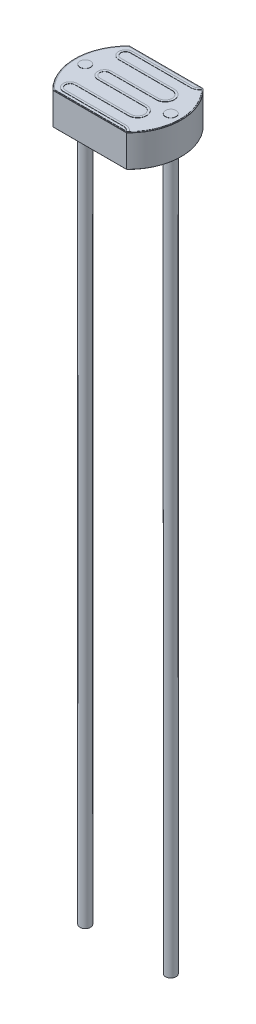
ISO-10303-21;
HEADER;
FILE_DESCRIPTION(('STEP AP214'),'2;1');
FILE_NAME('part.step','',(''),(''),'','','');
FILE_SCHEMA(('AUTOMOTIVE_DESIGN { 1 0 10303 214 1 1 1 1 }'));
ENDSEC;
DATA;
#1=APPLICATION_CONTEXT('core data for automotive mechanical design processes');
#2=APPLICATION_PROTOCOL_DEFINITION('international standard','automotive_design',2000,#1);
#3=PRODUCT_CONTEXT('',#1,'mechanical');
#4=PRODUCT('Part','Part','',(#3));
#5=PRODUCT_RELATED_PRODUCT_CATEGORY('part','',(#4));
#6=PRODUCT_DEFINITION_FORMATION('','',#4);
#7=PRODUCT_DEFINITION_CONTEXT('part definition',#1,'design');
#8=PRODUCT_DEFINITION('design','',#6,#7);
#9=PRODUCT_DEFINITION_SHAPE('','',#8);
#10=(LENGTH_UNIT() NAMED_UNIT(*) SI_UNIT(.MILLI.,.METRE.));
#11=(NAMED_UNIT(*) PLANE_ANGLE_UNIT() SI_UNIT($,.RADIAN.));
#12=(NAMED_UNIT(*) SI_UNIT($,.STERADIAN.) SOLID_ANGLE_UNIT());
#13=UNCERTAINTY_MEASURE_WITH_UNIT(LENGTH_MEASURE(1.E-05),#10,'distance_accuracy_value','');
#14=(GEOMETRIC_REPRESENTATION_CONTEXT(3) GLOBAL_UNCERTAINTY_ASSIGNED_CONTEXT((#13)) GLOBAL_UNIT_ASSIGNED_CONTEXT((#10,
#11,#12)) REPRESENTATION_CONTEXT('',''));
#15=CARTESIAN_POINT('',(0.,0.,0.));
#16=DIRECTION('',(0.,0.,1.));
#17=DIRECTION('',(1.,0.,0.));
#18=AXIS2_PLACEMENT_3D('',#15,#16,#17);
#19=CARTESIAN_POINT('',(0.,1.51,0.));
#20=DIRECTION('',(0.,1.,0.));
#21=DIRECTION('',(0.,0.,1.));
#22=AXIS2_PLACEMENT_3D('',#19,#20,#21);
#23=PLANE('',#22);
#24=CARTESIAN_POINT('',(-2.0097424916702,1.51,0.));
#25=DIRECTION('',(0.,1.,0.));
#26=DIRECTION('',(0.,0.,1.));
#27=AXIS2_PLACEMENT_3D('',#24,#25,#26);
#28=CIRCLE('',#27,0.25);
#29=CARTESIAN_POINT('',(-2.0097424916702,1.51,0.25));
#30=VERTEX_POINT('',#29);
#31=EDGE_CURVE('E380',#30,#30,#28,.T.);
#32=ORIENTED_EDGE('',*,*,#31,.F.);
#33=EDGE_LOOP('',(#32));
#34=FACE_BOUND('',#33,.T.);
#35=CARTESIAN_POINT('',(1.41487399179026,1.51,1.95));
#36=DIRECTION('',(0.,-1.,0.));
#37=DIRECTION('',(0.,0.,-1.));
#38=AXIS2_PLACEMENT_3D('',#35,#36,#37);
#39=CIRCLE('',#38,0.325);
#40=CARTESIAN_POINT('',(1.41487399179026,1.51,1.625));
#41=VERTEX_POINT('',#40);
#42=CARTESIAN_POINT('',(1.67104776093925,1.51,1.75));
#43=VERTEX_POINT('',#42);
#44=EDGE_CURVE('E455',#41,#43,#39,.T.);
#45=ORIENTED_EDGE('',*,*,#44,.F.);
#46=DIRECTION('',(1.,0.,0.));
#47=VECTOR('',#46,1.);
#48=CARTESIAN_POINT('',(-1.41562153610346,1.51,1.625));
#49=LINE('',#48,#47);
#50=CARTESIAN_POINT('',(-1.41562153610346,1.51,1.625));
#51=VERTEX_POINT('',#50);
#52=EDGE_CURVE('E328',#51,#41,#49,.T.);
#53=ORIENTED_EDGE('',*,*,#52,.F.);
#54=CARTESIAN_POINT('',(-1.41562153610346,1.51,1.3));
#55=DIRECTION('',(0.,1.,0.));
#56=DIRECTION('',(0.,0.,-1.));
#57=AXIS2_PLACEMENT_3D('',#54,#55,#56);
#58=CIRCLE('',#57,0.325);
#59=CARTESIAN_POINT('',(-1.41562153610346,1.51,0.974999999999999));
#60=VERTEX_POINT('',#59);
#61=EDGE_CURVE('E512',#60,#51,#58,.T.);
#62=ORIENTED_EDGE('',*,*,#61,.F.);
#63=DIRECTION('',(-1.,0.,0.));
#64=VECTOR('',#63,1.);
#65=CARTESIAN_POINT('',(-1.10022399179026,1.51,0.974999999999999));
#66=LINE('',#65,#64);
#67=CARTESIAN_POINT('',(1.10022399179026,1.51,0.974999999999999));
#68=VERTEX_POINT('',#67);
#69=EDGE_CURVE('E509',#68,#60,#66,.T.);
#70=ORIENTED_EDGE('',*,*,#69,.F.);
#71=CARTESIAN_POINT('',(1.10022399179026,1.51,0.649999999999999));
#72=DIRECTION('',(0.,-1.,0.));
#73=DIRECTION('',(0.,0.,-1.));
#74=AXIS2_PLACEMENT_3D('',#71,#72,#73);
#75=CIRCLE('',#74,0.325);
#76=CARTESIAN_POINT('',(1.10022399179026,1.51,0.324999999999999));
#77=VERTEX_POINT('',#76);
#78=EDGE_CURVE('E506',#77,#68,#75,.T.);
#79=ORIENTED_EDGE('',*,*,#78,.F.);
#80=DIRECTION('',(1.,0.,0.));
#81=VECTOR('',#80,1.);
#82=CARTESIAN_POINT('',(-1.10022399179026,1.51,0.325));
#83=LINE('',#82,#81);
#84=CARTESIAN_POINT('',(-1.10022399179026,1.51,0.325));
#85=VERTEX_POINT('',#84);
#86=EDGE_CURVE('E503',#85,#77,#83,.T.);
#87=ORIENTED_EDGE('',*,*,#86,.F.);
#88=CARTESIAN_POINT('',(-1.10022399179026,1.51,0.));
#89=DIRECTION('',(0.,1.,0.));
#90=DIRECTION('',(0.,0.,1.));
#91=AXIS2_PLACEMENT_3D('',#88,#89,#90);
#92=CIRCLE('',#91,0.325);
#93=CARTESIAN_POINT('',(-1.10022399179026,1.51,-0.325));
#94=VERTEX_POINT('',#93);
#95=EDGE_CURVE('E500',#94,#85,#92,.T.);
#96=ORIENTED_EDGE('',*,*,#95,.F.);
#97=DIRECTION('',(-1.,0.,0.));
#98=VECTOR('',#97,1.);
#99=CARTESIAN_POINT('',(-1.10022399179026,1.51,-0.325));
#100=LINE('',#99,#98);
#101=CARTESIAN_POINT('',(1.10022399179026,1.51,-0.325));
#102=VERTEX_POINT('',#101);
#103=EDGE_CURVE('E497',#102,#94,#100,.T.);
#104=ORIENTED_EDGE('',*,*,#103,.F.);
#105=CARTESIAN_POINT('',(1.10022399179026,1.51,-0.65));
#106=DIRECTION('',(0.,-1.,0.));
#107=DIRECTION('',(0.,0.,1.));
#108=AXIS2_PLACEMENT_3D('',#105,#106,#107);
#109=CIRCLE('',#108,0.325);
#110=CARTESIAN_POINT('',(1.10022399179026,1.51,-0.975));
#111=VERTEX_POINT('',#110);
#112=EDGE_CURVE('E494',#111,#102,#109,.T.);
#113=ORIENTED_EDGE('',*,*,#112,.F.);
#114=DIRECTION('',(1.,0.,0.));
#115=VECTOR('',#114,1.);
#116=CARTESIAN_POINT('',(1.10022399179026,1.51,-0.975));
#117=LINE('',#116,#115);
#118=CARTESIAN_POINT('',(-1.41562153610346,1.51,-0.975));
#119=VERTEX_POINT('',#118);
#120=EDGE_CURVE('E491',#119,#111,#117,.T.);
#121=ORIENTED_EDGE('',*,*,#120,.F.);
#122=CARTESIAN_POINT('',(-1.41562153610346,1.51,-1.3));
#123=DIRECTION('',(0.,1.,0.));
#124=DIRECTION('',(0.,0.,1.));
#125=AXIS2_PLACEMENT_3D('',#122,#123,#124);
#126=CIRCLE('',#125,0.325);
#127=CARTESIAN_POINT('',(-1.41562153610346,1.51,-1.625));
#128=VERTEX_POINT('',#127);
#129=EDGE_CURVE('E488',#128,#119,#126,.T.);
#130=ORIENTED_EDGE('',*,*,#129,.F.);
#131=DIRECTION('',(-1.,0.,0.));
#132=VECTOR('',#131,1.);
#133=CARTESIAN_POINT('',(-1.41562153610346,1.51,-1.625));
#134=LINE('',#133,#132);
#135=CARTESIAN_POINT('',(1.41487399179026,1.51,-1.625));
#136=VERTEX_POINT('',#135);
#137=EDGE_CURVE('E466',#136,#128,#134,.T.);
#138=ORIENTED_EDGE('',*,*,#137,.F.);
#139=CARTESIAN_POINT('',(1.41487399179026,1.51,-1.95));
#140=DIRECTION('',(0.,-1.,0.));
#141=DIRECTION('',(0.,0.,1.));
#142=AXIS2_PLACEMENT_3D('',#139,#140,#141);
#143=CIRCLE('',#142,0.325);
#144=CARTESIAN_POINT('',(1.67104776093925,1.51,-1.75));
#145=VERTEX_POINT('',#144);
#146=EDGE_CURVE('E463',#145,#136,#143,.T.);
#147=ORIENTED_EDGE('',*,*,#146,.F.);
#148=DIRECTION('',(-1.,0.,0.));
#149=VECTOR('',#148,1.);
#150=CARTESIAN_POINT('',(1.71464281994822,1.51,-1.75));
#151=LINE('',#150,#149);
#152=CARTESIAN_POINT('',(-1.71464281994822,1.51,-1.75));
#153=VERTEX_POINT('',#152);
#154=EDGE_CURVE('E359',#145,#153,#151,.T.);
#155=ORIENTED_EDGE('',*,*,#154,.T.);
#156=CARTESIAN_POINT('',(0.,1.51,0.));
#157=DIRECTION('',(0.,1.,0.));
#158=DIRECTION('',(0.,0.,1.));
#159=AXIS2_PLACEMENT_3D('',#156,#157,#158);
#160=CIRCLE('',#159,2.45);
#161=CARTESIAN_POINT('',(-1.71464281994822,1.51,1.75));
#162=VERTEX_POINT('',#161);
#163=EDGE_CURVE('E343',#153,#162,#160,.T.);
#164=ORIENTED_EDGE('',*,*,#163,.T.);
#165=DIRECTION('',(1.,0.,0.));
#166=VECTOR('',#165,1.);
#167=CARTESIAN_POINT('',(-1.71464281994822,1.51,1.75));
#168=LINE('',#167,#166);
#169=EDGE_CURVE('E346',#162,#43,#168,.T.);
#170=ORIENTED_EDGE('',*,*,#169,.T.);
#171=EDGE_LOOP('',(#45,#53,#62,#70,#79,#87,#96,#104,#113,#121,#130,#138,#147,#155,#164,#170));
#172=FACE_BOUND('',#171,.T.);
#173=ADVANCED_FACE('F34',(#34,#172),#23,.T.);
#174=CARTESIAN_POINT('',(0.,1.5,0.));
#175=DIRECTION('',(0.,1.,0.));
#176=DIRECTION('',(0.,0.,1.));
#177=AXIS2_PLACEMENT_3D('',#174,#175,#176);
#178=PLANE('',#177);
#179=CARTESIAN_POINT('',(0.,1.5,0.));
#180=DIRECTION('',(0.,1.,0.));
#181=DIRECTION('',(0.,0.,1.));
#182=AXIS2_PLACEMENT_3D('',#179,#180,#181);
#183=CIRCLE('',#182,2.49);
#184=CARTESIAN_POINT('',(1.73089572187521,1.5,1.79));
#185=VERTEX_POINT('',#184);
#186=CARTESIAN_POINT('',(1.73089572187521,1.5,-1.78999999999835));
#187=VERTEX_POINT('',#186);
#188=EDGE_CURVE('E731',#185,#187,#183,.T.);
#189=ORIENTED_EDGE('',*,*,#188,.T.);
#190=DIRECTION('',(-1.,0.,0.));
#191=VECTOR('',#190,1.);
#192=CARTESIAN_POINT('',(-1.73493515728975,1.5,-1.79));
#193=LINE('',#192,#191);
#194=CARTESIAN_POINT('',(-1.73089572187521,1.5,-1.78999999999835));
#195=VERTEX_POINT('',#194);
#196=EDGE_CURVE('E733',#187,#195,#193,.T.);
#197=ORIENTED_EDGE('',*,*,#196,.T.);
#198=CARTESIAN_POINT('',(0.,1.5,0.));
#199=DIRECTION('',(0.,1.,0.));
#200=DIRECTION('',(0.,0.,1.));
#201=AXIS2_PLACEMENT_3D('',#198,#199,#200);
#202=CIRCLE('',#201,2.49);
#203=CARTESIAN_POINT('',(-1.73089572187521,1.5,1.78999999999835));
#204=VERTEX_POINT('',#203);
#205=EDGE_CURVE('E727',#195,#204,#202,.T.);
#206=ORIENTED_EDGE('',*,*,#205,.T.);
#207=DIRECTION('',(1.,0.,0.));
#208=VECTOR('',#207,1.);
#209=CARTESIAN_POINT('',(1.73493515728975,1.5,1.79));
#210=LINE('',#209,#208);
#211=EDGE_CURVE('E729',#204,#185,#210,.T.);
#212=ORIENTED_EDGE('',*,*,#211,.T.);
#213=EDGE_LOOP('',(#189,#197,#206,#212));
#214=FACE_BOUND('',#213,.T.);
#215=DIRECTION('',(1.,0.,0.));
#216=VECTOR('',#215,1.);
#217=CARTESIAN_POINT('',(-1.71464281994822,1.5,1.75));
#218=LINE('',#217,#216);
#219=CARTESIAN_POINT('',(-1.71464281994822,1.5,1.75));
#220=VERTEX_POINT('',#219);
#221=CARTESIAN_POINT('',(1.71464281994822,1.5,1.75));
#222=VERTEX_POINT('',#221);
#223=EDGE_CURVE('E335',#220,#222,#218,.T.);
#224=ORIENTED_EDGE('',*,*,#223,.F.);
#225=CARTESIAN_POINT('',(0.,1.5,0.));
#226=DIRECTION('',(0.,1.,0.));
#227=DIRECTION('',(0.,0.,1.));
#228=AXIS2_PLACEMENT_3D('',#225,#226,#227);
#229=CIRCLE('',#228,2.45);
#230=CARTESIAN_POINT('',(-1.71464281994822,1.5,-1.75));
#231=VERTEX_POINT('',#230);
#232=EDGE_CURVE('E332',#231,#220,#229,.T.);
#233=ORIENTED_EDGE('',*,*,#232,.F.);
#234=DIRECTION('',(-1.,0.,0.));
#235=VECTOR('',#234,1.);
#236=CARTESIAN_POINT('',(1.71464281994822,1.5,-1.75));
#237=LINE('',#236,#235);
#238=CARTESIAN_POINT('',(1.71464281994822,1.5,-1.75));
#239=VERTEX_POINT('',#238);
#240=EDGE_CURVE('E347',#239,#231,#237,.T.);
#241=ORIENTED_EDGE('',*,*,#240,.F.);
#242=CARTESIAN_POINT('',(0.,1.5,0.));
#243=DIRECTION('',(0.,1.,0.));
#244=DIRECTION('',(0.,0.,1.));
#245=AXIS2_PLACEMENT_3D('',#242,#243,#244);
#246=CIRCLE('',#245,2.45);
#247=EDGE_CURVE('E367',#222,#239,#246,.T.);
#248=ORIENTED_EDGE('',*,*,#247,.F.);
#249=EDGE_LOOP('',(#224,#233,#241,#248));
#250=FACE_BOUND('',#249,.T.);
#251=ADVANCED_FACE('F658',(#214,#250),#178,.T.);
#252=CARTESIAN_POINT('',(0.,1.5,0.));
#253=DIRECTION('',(0.,-1.,0.));
#254=DIRECTION('',(0.,0.,-1.));
#255=AXIS2_PLACEMENT_3D('',#252,#253,#254);
#256=CYLINDRICAL_SURFACE('',#255,2.5);
#257=DIRECTION('',(0.,-1.,0.));
#258=VECTOR('',#257,1.);
#259=CARTESIAN_POINT('',(-1.73493515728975,1.5,-1.8));
#260=LINE('',#259,#258);
#261=CARTESIAN_POINT('',(-1.73493515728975,1.49,-1.8));
#262=VERTEX_POINT('',#261);
#263=CARTESIAN_POINT('',(-1.73493515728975,0.01,-1.8));
#264=VERTEX_POINT('',#263);
#265=EDGE_CURVE('E356',#262,#264,#260,.T.);
#266=ORIENTED_EDGE('',*,*,#265,.T.);
#267=CARTESIAN_POINT('',(0.,0.01,0.));
#268=DIRECTION('',(0.,1.,0.));
#269=DIRECTION('',(0.,0.,1.));
#270=AXIS2_PLACEMENT_3D('',#267,#268,#269);
#271=CIRCLE('',#270,2.5);
#272=CARTESIAN_POINT('',(-1.73784711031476,0.01,1.79718875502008));
#273=VERTEX_POINT('',#272);
#274=EDGE_CURVE('E11',#264,#273,#271,.T.);
#275=ORIENTED_EDGE('',*,*,#274,.T.);
#276=DIRECTION('',(0.,-1.,0.));
#277=VECTOR('',#276,1.);
#278=CARTESIAN_POINT('',(-1.73784711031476,1.5,1.79718875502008));
#279=LINE('',#278,#277);
#280=CARTESIAN_POINT('',(-1.73784711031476,1.49,1.79718875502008));
#281=VERTEX_POINT('',#280);
#282=EDGE_CURVE('E43',#273,#281,#279,.F.);
#283=ORIENTED_EDGE('',*,*,#282,.T.);
#284=CARTESIAN_POINT('',(0.,1.49,0.));
#285=DIRECTION('',(0.,1.,0.));
#286=DIRECTION('',(0.,0.,1.));
#287=AXIS2_PLACEMENT_3D('',#284,#285,#286);
#288=CIRCLE('',#287,2.5);
#289=EDGE_CURVE('E754',#281,#262,#288,.F.);
#290=ORIENTED_EDGE('',*,*,#289,.T.);
#291=EDGE_LOOP('',(#266,#275,#283,#290));
#292=FACE_BOUND('',#291,.T.);
#293=ADVANCED_FACE('F664',(#292),#256,.T.);
#294=CARTESIAN_POINT('',(-1.73493515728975,1.5,1.8));
#295=DIRECTION('',(0.,0.,-1.));
#296=DIRECTION('',(-1.,0.,0.));
#297=AXIS2_PLACEMENT_3D('',#294,#295,#296);
#298=PLANE('',#297);
#299=DIRECTION('',(1.,0.,0.));
#300=VECTOR('',#299,1.);
#301=CARTESIAN_POINT('',(-1.73493515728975,0.01,1.8));
#302=LINE('',#301,#300);
#303=CARTESIAN_POINT('',(-1.7308957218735,0.01,1.8));
#304=VERTEX_POINT('',#303);
#305=CARTESIAN_POINT('',(1.7308957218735,0.01,1.8));
#306=VERTEX_POINT('',#305);
#307=EDGE_CURVE('E749',#304,#306,#302,.T.);
#308=ORIENTED_EDGE('',*,*,#307,.T.);
#309=DIRECTION('',(0.,-1.,0.));
#310=VECTOR('',#309,1.);
#311=CARTESIAN_POINT('',(1.7308957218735,1.5,1.8));
#312=LINE('',#311,#310);
#313=CARTESIAN_POINT('',(1.7308957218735,1.49,1.8));
#314=VERTEX_POINT('',#313);
#315=EDGE_CURVE('E751',#306,#314,#312,.F.);
#316=ORIENTED_EDGE('',*,*,#315,.T.);
#317=DIRECTION('',(1.,0.,0.));
#318=VECTOR('',#317,1.);
#319=CARTESIAN_POINT('',(-1.73493515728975,1.49,1.8));
#320=LINE('',#319,#318);
#321=CARTESIAN_POINT('',(-1.7308957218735,1.49,1.8));
#322=VERTEX_POINT('',#321);
#323=EDGE_CURVE('E747',#314,#322,#320,.F.);
#324=ORIENTED_EDGE('',*,*,#323,.T.);
#325=DIRECTION('',(0.,-1.,0.));
#326=VECTOR('',#325,1.);
#327=CARTESIAN_POINT('',(-1.7308957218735,1.5,1.8));
#328=LINE('',#327,#326);
#329=EDGE_CURVE('E745',#322,#304,#328,.T.);
#330=ORIENTED_EDGE('',*,*,#329,.T.);
#331=EDGE_LOOP('',(#308,#316,#324,#330));
#332=FACE_BOUND('',#331,.T.);
#333=ADVANCED_FACE('F907',(#332),#298,.F.);
#334=CARTESIAN_POINT('',(0.,1.5,0.));
#335=DIRECTION('',(0.,-1.,0.));
#336=DIRECTION('',(0.,0.,-1.));
#337=AXIS2_PLACEMENT_3D('',#334,#335,#336);
#338=CYLINDRICAL_SURFACE('',#337,2.5);
#339=CARTESIAN_POINT('',(0.,0.01,0.));
#340=DIRECTION('',(0.,1.,0.));
#341=DIRECTION('',(0.,0.,1.));
#342=AXIS2_PLACEMENT_3D('',#339,#340,#341);
#343=CIRCLE('',#342,2.5);
#344=CARTESIAN_POINT('',(1.73784711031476,0.01,1.79718875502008));
#345=VERTEX_POINT('',#344);
#346=CARTESIAN_POINT('',(1.73784711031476,0.01,-1.79718875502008));
#347=VERTEX_POINT('',#346);
#348=EDGE_CURVE('E722',#345,#347,#343,.T.);
#349=ORIENTED_EDGE('',*,*,#348,.T.);
#350=DIRECTION('',(0.,-1.,0.));
#351=VECTOR('',#350,1.);
#352=CARTESIAN_POINT('',(1.73784711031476,1.5,-1.79718875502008));
#353=LINE('',#352,#351);
#354=CARTESIAN_POINT('',(1.73784711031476,1.49,-1.79718875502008));
#355=VERTEX_POINT('',#354);
#356=EDGE_CURVE('E724',#347,#355,#353,.F.);
#357=ORIENTED_EDGE('',*,*,#356,.T.);
#358=CARTESIAN_POINT('',(0.,1.49,0.));
#359=DIRECTION('',(0.,1.,0.));
#360=DIRECTION('',(0.,0.,1.));
#361=AXIS2_PLACEMENT_3D('',#358,#359,#360);
#362=CIRCLE('',#361,2.5);
#363=CARTESIAN_POINT('',(1.73784711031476,1.49,1.79718875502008));
#364=VERTEX_POINT('',#363);
#365=EDGE_CURVE('E720',#355,#364,#362,.F.);
#366=ORIENTED_EDGE('',*,*,#365,.T.);
#367=DIRECTION('',(0.,-1.,0.));
#368=VECTOR('',#367,1.);
#369=CARTESIAN_POINT('',(1.73784711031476,1.5,1.79718875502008));
#370=LINE('',#369,#368);
#371=EDGE_CURVE('E718',#364,#345,#370,.T.);
#372=ORIENTED_EDGE('',*,*,#371,.T.);
#373=EDGE_LOOP('',(#349,#357,#366,#372));
#374=FACE_BOUND('',#373,.T.);
#375=ADVANCED_FACE('F919',(#374),#338,.T.);
#376=CARTESIAN_POINT('',(-1.73493515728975,1.5,-1.8));
#377=DIRECTION('',(0.,0.,1.));
#378=DIRECTION('',(1.,0.,0.));
#379=AXIS2_PLACEMENT_3D('',#376,#377,#378);
#380=PLANE('',#379);
#381=ORIENTED_EDGE('',*,*,#265,.F.);
#382=DIRECTION('',(-1.,0.,0.));
#383=VECTOR('',#382,1.);
#384=CARTESIAN_POINT('',(1.73493515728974,1.49,-1.8));
#385=LINE('',#384,#383);
#386=CARTESIAN_POINT('',(1.7308957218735,1.49,-1.8));
#387=VERTEX_POINT('',#386);
#388=EDGE_CURVE('E716',#262,#387,#385,.F.);
#389=ORIENTED_EDGE('',*,*,#388,.T.);
#390=DIRECTION('',(0.,-1.,0.));
#391=VECTOR('',#390,1.);
#392=CARTESIAN_POINT('',(1.7308957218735,1.5,-1.8));
#393=LINE('',#392,#391);
#394=CARTESIAN_POINT('',(1.7308957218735,0.01,-1.8));
#395=VERTEX_POINT('',#394);
#396=EDGE_CURVE('E713',#387,#395,#393,.T.);
#397=ORIENTED_EDGE('',*,*,#396,.T.);
#398=DIRECTION('',(-1.,0.,0.));
#399=VECTOR('',#398,1.);
#400=CARTESIAN_POINT('',(-1.73493515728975,0.01,-1.8));
#401=LINE('',#400,#399);
#402=EDGE_CURVE('E388',#395,#264,#401,.T.);
#403=ORIENTED_EDGE('',*,*,#402,.T.);
#404=EDGE_LOOP('',(#381,#389,#397,#403));
#405=FACE_BOUND('',#404,.T.);
#406=ADVANCED_FACE('F894',(#405),#380,.F.);
#407=CARTESIAN_POINT('',(0.,0.,0.));
#408=DIRECTION('',(0.,1.,0.));
#409=DIRECTION('',(0.,0.,1.));
#410=AXIS2_PLACEMENT_3D('',#407,#408,#409);
#411=PLANE('',#410);
#412=CARTESIAN_POINT('',(0.,0.,0.));
#413=DIRECTION('',(0.,1.,0.));
#414=DIRECTION('',(0.,0.,1.));
#415=AXIS2_PLACEMENT_3D('',#412,#413,#414);
#416=CIRCLE('',#415,2.49);
#417=CARTESIAN_POINT('',(-1.73089572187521,0.,1.78999999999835));
#418=VERTEX_POINT('',#417);
#419=CARTESIAN_POINT('',(-1.73089572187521,0.,-1.78999999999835));
#420=VERTEX_POINT('',#419);
#421=EDGE_CURVE('E736',#418,#420,#416,.F.);
#422=ORIENTED_EDGE('',*,*,#421,.T.);
#423=DIRECTION('',(-1.,0.,0.));
#424=VECTOR('',#423,1.);
#425=CARTESIAN_POINT('',(0.,0.,-1.79));
#426=LINE('',#425,#424);
#427=CARTESIAN_POINT('',(1.73089572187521,0.,-1.78999999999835));
#428=VERTEX_POINT('',#427);
#429=EDGE_CURVE('E742',#420,#428,#426,.F.);
#430=ORIENTED_EDGE('',*,*,#429,.T.);
#431=CARTESIAN_POINT('',(0.,0.,0.));
#432=DIRECTION('',(0.,1.,0.));
#433=DIRECTION('',(0.,0.,1.));
#434=AXIS2_PLACEMENT_3D('',#431,#432,#433);
#435=CIRCLE('',#434,2.49);
#436=CARTESIAN_POINT('',(1.73089572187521,0.,1.79));
#437=VERTEX_POINT('',#436);
#438=EDGE_CURVE('E740',#428,#437,#435,.F.);
#439=ORIENTED_EDGE('',*,*,#438,.T.);
#440=DIRECTION('',(1.,0.,0.));
#441=VECTOR('',#440,1.);
#442=CARTESIAN_POINT('',(0.,0.,1.79));
#443=LINE('',#442,#441);
#444=EDGE_CURVE('E738',#437,#418,#443,.F.);
#445=ORIENTED_EDGE('',*,*,#444,.T.);
#446=EDGE_LOOP('',(#422,#430,#439,#445));
#447=FACE_BOUND('',#446,.T.);
#448=CARTESIAN_POINT('',(2.0097424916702,0.,0.));
#449=DIRECTION('',(0.,1.,0.));
#450=DIRECTION('',(0.,0.,1.));
#451=AXIS2_PLACEMENT_3D('',#448,#449,#450);
#452=CIRCLE('',#451,0.25);
#453=CARTESIAN_POINT('',(2.0097424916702,0.,0.25));
#454=VERTEX_POINT('',#453);
#455=EDGE_CURVE('E693',#454,#454,#452,.T.);
#456=ORIENTED_EDGE('',*,*,#455,.T.);
#457=EDGE_LOOP('',(#456));
#458=FACE_BOUND('',#457,.T.);
#459=CARTESIAN_POINT('',(-2.0097424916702,0.,0.));
#460=DIRECTION('',(0.,1.,0.));
#461=DIRECTION('',(0.,0.,1.));
#462=AXIS2_PLACEMENT_3D('',#459,#460,#461);
#463=CIRCLE('',#462,0.25);
#464=CARTESIAN_POINT('',(-2.0097424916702,0.,0.25));
#465=VERTEX_POINT('',#464);
#466=EDGE_CURVE('E457',#465,#465,#463,.T.);
#467=ORIENTED_EDGE('',*,*,#466,.T.);
#468=EDGE_LOOP('',(#467));
#469=FACE_BOUND('',#468,.T.);
#470=ADVANCED_FACE('F1363',(#447,#458,#469),#411,.F.);
#471=CARTESIAN_POINT('',(0.,1.51,0.));
#472=DIRECTION('',(0.,-1.,0.));
#473=DIRECTION('',(0.,0.,-1.));
#474=AXIS2_PLACEMENT_3D('',#471,#472,#473);
#475=CYLINDRICAL_SURFACE('',#474,2.45);
#476=ORIENTED_EDGE('',*,*,#232,.T.);
#477=DIRECTION('',(0.,-1.,0.));
#478=VECTOR('',#477,1.);
#479=CARTESIAN_POINT('',(-1.71464281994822,1.51,1.75));
#480=LINE('',#479,#478);
#481=EDGE_CURVE('E377',#162,#220,#480,.T.);
#482=ORIENTED_EDGE('',*,*,#481,.F.);
#483=ORIENTED_EDGE('',*,*,#163,.F.);
#484=DIRECTION('',(0.,-1.,0.));
#485=VECTOR('',#484,1.);
#486=CARTESIAN_POINT('',(-1.71464281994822,1.51,-1.75));
#487=LINE('',#486,#485);
#488=EDGE_CURVE('E361',#153,#231,#487,.T.);
#489=ORIENTED_EDGE('',*,*,#488,.T.);
#490=EDGE_LOOP('',(#476,#482,#483,#489));
#491=FACE_BOUND('',#490,.T.);
#492=ADVANCED_FACE('F1353',(#491),#475,.T.);
#493=CARTESIAN_POINT('',(-1.71464281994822,1.51,1.75));
#494=DIRECTION('',(0.,0.,-1.));
#495=DIRECTION('',(-1.,0.,0.));
#496=AXIS2_PLACEMENT_3D('',#493,#494,#495);
#497=PLANE('',#496);
#498=ORIENTED_EDGE('',*,*,#223,.T.);
#499=DIRECTION('',(0.,-1.,0.));
#500=VECTOR('',#499,1.);
#501=CARTESIAN_POINT('',(1.71464281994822,1.51,1.75));
#502=LINE('',#501,#500);
#503=CARTESIAN_POINT('',(1.71464281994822,1.52,1.75));
#504=VERTEX_POINT('',#503);
#505=EDGE_CURVE('E375',#504,#222,#502,.T.);
#506=ORIENTED_EDGE('',*,*,#505,.F.);
#507=DIRECTION('',(1.,0.,0.));
#508=VECTOR('',#507,1.);
#509=CARTESIAN_POINT('',(1.71464281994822,1.52,1.75));
#510=LINE('',#509,#508);
#511=CARTESIAN_POINT('',(1.67104776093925,1.52,1.75));
#512=VERTEX_POINT('',#511);
#513=EDGE_CURVE('E318',#512,#504,#510,.T.);
#514=ORIENTED_EDGE('',*,*,#513,.F.);
#515=DIRECTION('',(0.,-1.,0.));
#516=VECTOR('',#515,1.);
#517=CARTESIAN_POINT('',(1.67104776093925,1.52,1.75));
#518=LINE('',#517,#516);
#519=EDGE_CURVE('E314',#512,#43,#518,.T.);
#520=ORIENTED_EDGE('',*,*,#519,.T.);
#521=ORIENTED_EDGE('',*,*,#169,.F.);
#522=ORIENTED_EDGE('',*,*,#481,.T.);
#523=EDGE_LOOP('',(#498,#506,#514,#520,#521,#522));
#524=FACE_BOUND('',#523,.T.);
#525=ADVANCED_FACE('F1343',(#524),#497,.F.);
#526=CARTESIAN_POINT('',(0.,1.51,0.));
#527=DIRECTION('',(0.,-1.,0.));
#528=DIRECTION('',(0.,0.,-1.));
#529=AXIS2_PLACEMENT_3D('',#526,#527,#528);
#530=CYLINDRICAL_SURFACE('',#529,2.45);
#531=ORIENTED_EDGE('',*,*,#247,.T.);
#532=DIRECTION('',(0.,-1.,0.));
#533=VECTOR('',#532,1.);
#534=CARTESIAN_POINT('',(1.71464281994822,1.51,-1.75));
#535=LINE('',#534,#533);
#536=CARTESIAN_POINT('',(1.71464281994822,1.52,-1.75));
#537=VERTEX_POINT('',#536);
#538=EDGE_CURVE('E373',#537,#239,#535,.T.);
#539=ORIENTED_EDGE('',*,*,#538,.F.);
#540=CARTESIAN_POINT('',(0.,1.52,0.));
#541=DIRECTION('',(0.,1.,0.));
#542=DIRECTION('',(0.,0.,1.));
#543=AXIS2_PLACEMENT_3D('',#540,#541,#542);
#544=CIRCLE('',#543,2.45);
#545=CARTESIAN_POINT('',(1.76098531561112,1.52,-1.70335865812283));
#546=VERTEX_POINT('',#545);
#547=EDGE_CURVE('E423',#546,#537,#544,.T.);
#548=ORIENTED_EDGE('',*,*,#547,.F.);
#549=DIRECTION('',(0.,-1.,0.));
#550=VECTOR('',#549,1.);
#551=CARTESIAN_POINT('',(1.76098531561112,1.52,-1.70335865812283));
#552=LINE('',#551,#550);
#553=CARTESIAN_POINT('',(1.76098531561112,1.51,-1.70335865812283));
#554=VERTEX_POINT('',#553);
#555=EDGE_CURVE('E473',#546,#554,#552,.T.);
#556=ORIENTED_EDGE('',*,*,#555,.T.);
#557=CARTESIAN_POINT('',(0.,1.51,0.));
#558=DIRECTION('',(0.,1.,0.));
#559=DIRECTION('',(0.,0.,1.));
#560=AXIS2_PLACEMENT_3D('',#557,#558,#559);
#561=CIRCLE('',#560,2.45);
#562=CARTESIAN_POINT('',(1.76098531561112,1.51,1.70335865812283));
#563=VERTEX_POINT('',#562);
#564=EDGE_CURVE('E355',#563,#554,#561,.T.);
#565=ORIENTED_EDGE('',*,*,#564,.F.);
#566=DIRECTION('',(0.,-1.,0.));
#567=VECTOR('',#566,1.);
#568=CARTESIAN_POINT('',(1.76098531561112,1.52,1.70335865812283));
#569=LINE('',#568,#567);
#570=CARTESIAN_POINT('',(1.76098531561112,1.52,1.70335865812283));
#571=VERTEX_POINT('',#570);
#572=EDGE_CURVE('E337',#571,#563,#569,.T.);
#573=ORIENTED_EDGE('',*,*,#572,.F.);
#574=CARTESIAN_POINT('',(0.,1.52,0.));
#575=DIRECTION('',(0.,1.,0.));
#576=DIRECTION('',(0.,0.,-1.));
#577=AXIS2_PLACEMENT_3D('',#574,#575,#576);
#578=CIRCLE('',#577,2.45);
#579=EDGE_CURVE('E395',#504,#571,#578,.T.);
#580=ORIENTED_EDGE('',*,*,#579,.F.);
#581=ORIENTED_EDGE('',*,*,#505,.T.);
#582=EDGE_LOOP('',(#531,#539,#548,#556,#565,#573,#580,#581));
#583=FACE_BOUND('',#582,.T.);
#584=ADVANCED_FACE('F596',(#583),#530,.T.);
#585=CARTESIAN_POINT('',(1.71464281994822,1.51,-1.75));
#586=DIRECTION('',(0.,0.,1.));
#587=DIRECTION('',(1.,0.,0.));
#588=AXIS2_PLACEMENT_3D('',#585,#586,#587);
#589=PLANE('',#588);
#590=ORIENTED_EDGE('',*,*,#240,.T.);
#591=ORIENTED_EDGE('',*,*,#488,.F.);
#592=ORIENTED_EDGE('',*,*,#154,.F.);
#593=DIRECTION('',(0.,-1.,0.));
#594=VECTOR('',#593,1.);
#595=CARTESIAN_POINT('',(1.67104776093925,1.52,-1.75));
#596=LINE('',#595,#594);
#597=CARTESIAN_POINT('',(1.67104776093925,1.52,-1.75));
#598=VERTEX_POINT('',#597);
#599=EDGE_CURVE('E470',#598,#145,#596,.T.);
#600=ORIENTED_EDGE('',*,*,#599,.F.);
#601=DIRECTION('',(-1.,0.,0.));
#602=VECTOR('',#601,1.);
#603=CARTESIAN_POINT('',(1.71464281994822,1.52,-1.75));
#604=LINE('',#603,#602);
#605=EDGE_CURVE('E426',#537,#598,#604,.T.);
#606=ORIENTED_EDGE('',*,*,#605,.F.);
#607=ORIENTED_EDGE('',*,*,#538,.T.);
#608=EDGE_LOOP('',(#590,#591,#592,#600,#606,#607));
#609=FACE_BOUND('',#608,.T.);
#610=ADVANCED_FACE('F671',(#609),#589,.F.);
#611=CARTESIAN_POINT('',(2.0097424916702,1.51,0.));
#612=DIRECTION('',(0.,1.,0.));
#613=DIRECTION('',(0.,0.,1.));
#614=AXIS2_PLACEMENT_3D('',#611,#612,#613);
#615=CIRCLE('',#614,0.25);
#616=CARTESIAN_POINT('',(2.0097424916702,1.51,0.25));
#617=VERTEX_POINT('',#616);
#618=EDGE_CURVE('E383',#617,#617,#615,.T.);
#619=ORIENTED_EDGE('',*,*,#618,.F.);
#620=EDGE_LOOP('',(#619));
#621=FACE_BOUND('',#620,.T.);
#622=CARTESIAN_POINT('',(1.41487399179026,1.51,-1.95));
#623=DIRECTION('',(0.,1.,0.));
#624=DIRECTION('',(0.,0.,1.));
#625=AXIS2_PLACEMENT_3D('',#622,#623,#624);
#626=CIRCLE('',#625,0.425);
#627=CARTESIAN_POINT('',(1.41487399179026,1.51,-1.525));
#628=VERTEX_POINT('',#627);
#629=EDGE_CURVE('E467',#628,#554,#626,.T.);
#630=ORIENTED_EDGE('',*,*,#629,.F.);
#631=DIRECTION('',(1.,0.,0.));
#632=VECTOR('',#631,1.);
#633=CARTESIAN_POINT('',(1.10022399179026,1.51,-1.525));
#634=LINE('',#633,#632);
#635=CARTESIAN_POINT('',(-1.41562153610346,1.51,-1.525));
#636=VERTEX_POINT('',#635);
#637=EDGE_CURVE('E480',#636,#628,#634,.T.);
#638=ORIENTED_EDGE('',*,*,#637,.F.);
#639=CARTESIAN_POINT('',(-1.41562153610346,1.51,-1.3));
#640=DIRECTION('',(0.,-1.,0.));
#641=DIRECTION('',(0.,0.,1.));
#642=AXIS2_PLACEMENT_3D('',#639,#640,#641);
#643=CIRCLE('',#642,0.225);
#644=CARTESIAN_POINT('',(-1.41562153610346,1.51,-1.075));
#645=VERTEX_POINT('',#644);
#646=EDGE_CURVE('E612',#645,#636,#643,.T.);
#647=ORIENTED_EDGE('',*,*,#646,.F.);
#648=DIRECTION('',(-1.,0.,0.));
#649=VECTOR('',#648,1.);
#650=CARTESIAN_POINT('',(-1.10022399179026,1.51,-1.075));
#651=LINE('',#650,#649);
#652=CARTESIAN_POINT('',(1.10022399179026,1.51,-1.075));
#653=VERTEX_POINT('',#652);
#654=EDGE_CURVE('E613',#653,#645,#651,.T.);
#655=ORIENTED_EDGE('',*,*,#654,.F.);
#656=CARTESIAN_POINT('',(1.10022399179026,1.51,-0.65));
#657=DIRECTION('',(0.,1.,0.));
#658=DIRECTION('',(0.,0.,1.));
#659=AXIS2_PLACEMENT_3D('',#656,#657,#658);
#660=CIRCLE('',#659,0.425);
#661=CARTESIAN_POINT('',(1.10022399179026,1.51,-0.225));
#662=VERTEX_POINT('',#661);
#663=EDGE_CURVE('E616',#662,#653,#660,.T.);
#664=ORIENTED_EDGE('',*,*,#663,.F.);
#665=DIRECTION('',(1.,0.,0.));
#666=VECTOR('',#665,1.);
#667=CARTESIAN_POINT('',(-1.10022399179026,1.51,-0.225));
#668=LINE('',#667,#666);
#669=CARTESIAN_POINT('',(-1.10022399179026,1.51,-0.225));
#670=VERTEX_POINT('',#669);
#671=EDGE_CURVE('E621',#670,#662,#668,.T.);
#672=ORIENTED_EDGE('',*,*,#671,.F.);
#673=CARTESIAN_POINT('',(-1.10022399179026,1.51,0.));
#674=DIRECTION('',(0.,-1.,0.));
#675=DIRECTION('',(0.,0.,1.));
#676=AXIS2_PLACEMENT_3D('',#673,#674,#675);
#677=CIRCLE('',#676,0.225);
#678=CARTESIAN_POINT('',(-1.10022399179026,1.51,0.225));
#679=VERTEX_POINT('',#678);
#680=EDGE_CURVE('E624',#679,#670,#677,.T.);
#681=ORIENTED_EDGE('',*,*,#680,.F.);
#682=DIRECTION('',(-1.,0.,0.));
#683=VECTOR('',#682,1.);
#684=CARTESIAN_POINT('',(-1.10022399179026,1.51,0.225));
#685=LINE('',#684,#683);
#686=CARTESIAN_POINT('',(1.10022399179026,1.51,0.224999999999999));
#687=VERTEX_POINT('',#686);
#688=EDGE_CURVE('E627',#687,#679,#685,.T.);
#689=ORIENTED_EDGE('',*,*,#688,.F.);
#690=CARTESIAN_POINT('',(1.10022399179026,1.51,0.649999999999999));
#691=DIRECTION('',(0.,1.,0.));
#692=DIRECTION('',(0.,0.,-1.));
#693=AXIS2_PLACEMENT_3D('',#690,#691,#692);
#694=CIRCLE('',#693,0.425);
#695=CARTESIAN_POINT('',(1.10022399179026,1.51,1.075));
#696=VERTEX_POINT('',#695);
#697=EDGE_CURVE('E630',#696,#687,#694,.T.);
#698=ORIENTED_EDGE('',*,*,#697,.F.);
#699=DIRECTION('',(1.,0.,0.));
#700=VECTOR('',#699,1.);
#701=CARTESIAN_POINT('',(1.10022399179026,1.51,1.075));
#702=LINE('',#701,#700);
#703=CARTESIAN_POINT('',(-1.41562153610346,1.51,1.075));
#704=VERTEX_POINT('',#703);
#705=EDGE_CURVE('E633',#704,#696,#702,.T.);
#706=ORIENTED_EDGE('',*,*,#705,.F.);
#707=CARTESIAN_POINT('',(-1.41562153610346,1.51,1.3));
#708=DIRECTION('',(0.,-1.,0.));
#709=DIRECTION('',(0.,0.,-1.));
#710=AXIS2_PLACEMENT_3D('',#707,#708,#709);
#711=CIRCLE('',#710,0.225);
#712=CARTESIAN_POINT('',(-1.41562153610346,1.51,1.525));
#713=VERTEX_POINT('',#712);
#714=EDGE_CURVE('E635',#713,#704,#711,.T.);
#715=ORIENTED_EDGE('',*,*,#714,.F.);
#716=DIRECTION('',(-1.,0.,0.));
#717=VECTOR('',#716,1.);
#718=CARTESIAN_POINT('',(-1.41562153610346,1.51,1.525));
#719=LINE('',#718,#717);
#720=CARTESIAN_POINT('',(1.41487399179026,1.51,1.525));
#721=VERTEX_POINT('',#720);
#722=EDGE_CURVE('E452',#721,#713,#719,.T.);
#723=ORIENTED_EDGE('',*,*,#722,.F.);
#724=CARTESIAN_POINT('',(1.41487399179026,1.51,1.95));
#725=DIRECTION('',(0.,1.,0.));
#726=DIRECTION('',(0.,0.,-1.));
#727=AXIS2_PLACEMENT_3D('',#724,#725,#726);
#728=CIRCLE('',#727,0.425);
#729=EDGE_CURVE('E362',#563,#721,#728,.T.);
#730=ORIENTED_EDGE('',*,*,#729,.F.);
#731=ORIENTED_EDGE('',*,*,#564,.T.);
#732=EDGE_LOOP('',(#630,#638,#647,#655,#664,#672,#681,#689,#698,#706,#715,#723,#730,#731));
#733=FACE_BOUND('',#732,.T.);
#734=ADVANCED_FACE('F601',(#621,#733),#23,.T.);
#735=CARTESIAN_POINT('',(1.41487399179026,1.52,1.95));
#736=DIRECTION('',(0.,-1.,0.));
#737=DIRECTION('',(0.,0.,-1.));
#738=AXIS2_PLACEMENT_3D('',#735,#736,#737);
#739=CYLINDRICAL_SURFACE('',#738,0.325);
#740=ORIENTED_EDGE('',*,*,#44,.T.);
#741=ORIENTED_EDGE('',*,*,#519,.F.);
#742=CARTESIAN_POINT('',(1.41487399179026,1.52,1.95));
#743=DIRECTION('',(0.,-1.,0.));
#744=DIRECTION('',(0.,0.,-1.));
#745=AXIS2_PLACEMENT_3D('',#742,#743,#744);
#746=CIRCLE('',#745,0.325);
#747=CARTESIAN_POINT('',(1.41487399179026,1.52,1.625));
#748=VERTEX_POINT('',#747);
#749=EDGE_CURVE('E307',#748,#512,#746,.T.);
#750=ORIENTED_EDGE('',*,*,#749,.F.);
#751=DIRECTION('',(0.,-1.,0.));
#752=VECTOR('',#751,1.);
#753=CARTESIAN_POINT('',(1.41487399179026,1.52,1.625));
#754=LINE('',#753,#752);
#755=EDGE_CURVE('E312',#748,#41,#754,.T.);
#756=ORIENTED_EDGE('',*,*,#755,.T.);
#757=EDGE_LOOP('',(#740,#741,#750,#756));
#758=FACE_BOUND('',#757,.T.);
#759=ADVANCED_FACE('F310',(#758),#739,.F.);
#760=CARTESIAN_POINT('',(1.41487399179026,1.52,1.95));
#761=DIRECTION('',(0.,-1.,0.));
#762=DIRECTION('',(0.,0.,-1.));
#763=AXIS2_PLACEMENT_3D('',#760,#761,#762);
#764=CYLINDRICAL_SURFACE('',#763,0.425);
#765=ORIENTED_EDGE('',*,*,#729,.T.);
#766=DIRECTION('',(0.,-1.,0.));
#767=VECTOR('',#766,1.);
#768=CARTESIAN_POINT('',(1.41487399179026,1.52,1.525));
#769=LINE('',#768,#767);
#770=CARTESIAN_POINT('',(1.41487399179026,1.52,1.525));
#771=VERTEX_POINT('',#770);
#772=EDGE_CURVE('E341',#771,#721,#769,.T.);
#773=ORIENTED_EDGE('',*,*,#772,.F.);
#774=CARTESIAN_POINT('',(1.41487399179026,1.52,1.95));
#775=DIRECTION('',(0.,1.,0.));
#776=DIRECTION('',(0.,0.,-1.));
#777=AXIS2_PLACEMENT_3D('',#774,#775,#776);
#778=CIRCLE('',#777,0.425);
#779=EDGE_CURVE('E397',#571,#771,#778,.T.);
#780=ORIENTED_EDGE('',*,*,#779,.F.);
#781=ORIENTED_EDGE('',*,*,#572,.T.);
#782=EDGE_LOOP('',(#765,#773,#780,#781));
#783=FACE_BOUND('',#782,.T.);
#784=ADVANCED_FACE('F592',(#783),#764,.T.);
#785=CARTESIAN_POINT('',(-1.41562153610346,1.52,1.525));
#786=DIRECTION('',(0.,0.,1.));
#787=DIRECTION('',(1.,0.,0.));
#788=AXIS2_PLACEMENT_3D('',#785,#786,#787);
#789=PLANE('',#788);
#790=ORIENTED_EDGE('',*,*,#722,.T.);
#791=DIRECTION('',(0.,-1.,0.));
#792=VECTOR('',#791,1.);
#793=CARTESIAN_POINT('',(-1.41562153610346,1.52,1.525));
#794=LINE('',#793,#792);
#795=CARTESIAN_POINT('',(-1.41562153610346,1.52,1.525));
#796=VERTEX_POINT('',#795);
#797=EDGE_CURVE('E575',#796,#713,#794,.T.);
#798=ORIENTED_EDGE('',*,*,#797,.F.);
#799=DIRECTION('',(-1.,0.,0.));
#800=VECTOR('',#799,1.);
#801=CARTESIAN_POINT('',(1.10022399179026,1.52,1.525));
#802=LINE('',#801,#800);
#803=EDGE_CURVE('E399',#771,#796,#802,.T.);
#804=ORIENTED_EDGE('',*,*,#803,.F.);
#805=ORIENTED_EDGE('',*,*,#772,.T.);
#806=EDGE_LOOP('',(#790,#798,#804,#805));
#807=FACE_BOUND('',#806,.T.);
#808=ADVANCED_FACE('F637',(#807),#789,.F.);
#809=CARTESIAN_POINT('',(-1.41562153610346,1.52,1.3));
#810=DIRECTION('',(0.,-1.,0.));
#811=DIRECTION('',(0.,0.,-1.));
#812=AXIS2_PLACEMENT_3D('',#809,#810,#811);
#813=CYLINDRICAL_SURFACE('',#812,0.225);
#814=ORIENTED_EDGE('',*,*,#714,.T.);
#815=DIRECTION('',(0.,-1.,0.));
#816=VECTOR('',#815,1.);
#817=CARTESIAN_POINT('',(-1.41562153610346,1.52,1.075));
#818=LINE('',#817,#816);
#819=CARTESIAN_POINT('',(-1.41562153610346,1.52,1.075));
#820=VERTEX_POINT('',#819);
#821=EDGE_CURVE('E573',#820,#704,#818,.T.);
#822=ORIENTED_EDGE('',*,*,#821,.F.);
#823=CARTESIAN_POINT('',(-1.41562153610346,1.52,1.3));
#824=DIRECTION('',(0.,-1.,0.));
#825=DIRECTION('',(0.,0.,-1.));
#826=AXIS2_PLACEMENT_3D('',#823,#824,#825);
#827=CIRCLE('',#826,0.225);
#828=EDGE_CURVE('E401',#796,#820,#827,.T.);
#829=ORIENTED_EDGE('',*,*,#828,.F.);
#830=ORIENTED_EDGE('',*,*,#797,.T.);
#831=EDGE_LOOP('',(#814,#822,#829,#830));
#832=FACE_BOUND('',#831,.T.);
#833=ADVANCED_FACE('F648',(#832),#813,.F.);
#834=CARTESIAN_POINT('',(1.10022399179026,1.52,1.075));
#835=DIRECTION('',(0.,0.,-1.));
#836=DIRECTION('',(-1.,0.,0.));
#837=AXIS2_PLACEMENT_3D('',#834,#835,#836);
#838=PLANE('',#837);
#839=ORIENTED_EDGE('',*,*,#705,.T.);
#840=DIRECTION('',(0.,-1.,0.));
#841=VECTOR('',#840,1.);
#842=CARTESIAN_POINT('',(1.10022399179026,1.52,1.075));
#843=LINE('',#842,#841);
#844=CARTESIAN_POINT('',(1.10022399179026,1.52,1.075));
#845=VERTEX_POINT('',#844);
#846=EDGE_CURVE('E570',#845,#696,#843,.T.);
#847=ORIENTED_EDGE('',*,*,#846,.F.);
#848=DIRECTION('',(1.,0.,0.));
#849=VECTOR('',#848,1.);
#850=CARTESIAN_POINT('',(-1.10022399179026,1.52,1.075));
#851=LINE('',#850,#849);
#852=EDGE_CURVE('E403',#820,#845,#851,.T.);
#853=ORIENTED_EDGE('',*,*,#852,.F.);
#854=ORIENTED_EDGE('',*,*,#821,.T.);
#855=EDGE_LOOP('',(#839,#847,#853,#854));
#856=FACE_BOUND('',#855,.T.);
#857=ADVANCED_FACE('F640',(#856),#838,.F.);
#858=CARTESIAN_POINT('',(1.10022399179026,1.52,0.649999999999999));
#859=DIRECTION('',(0.,-1.,0.));
#860=DIRECTION('',(0.,0.,-1.));
#861=AXIS2_PLACEMENT_3D('',#858,#859,#860);
#862=CYLINDRICAL_SURFACE('',#861,0.425);
#863=ORIENTED_EDGE('',*,*,#697,.T.);
#864=DIRECTION('',(0.,-1.,0.));
#865=VECTOR('',#864,1.);
#866=CARTESIAN_POINT('',(1.10022399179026,1.52,0.224999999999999));
#867=LINE('',#866,#865);
#868=CARTESIAN_POINT('',(1.10022399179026,1.52,0.224999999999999));
#869=VERTEX_POINT('',#868);
#870=EDGE_CURVE('E567',#869,#687,#867,.T.);
#871=ORIENTED_EDGE('',*,*,#870,.F.);
#872=CARTESIAN_POINT('',(1.10022399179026,1.52,0.649999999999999));
#873=DIRECTION('',(0.,1.,0.));
#874=DIRECTION('',(0.,0.,-1.));
#875=AXIS2_PLACEMENT_3D('',#872,#873,#874);
#876=CIRCLE('',#875,0.425);
#877=EDGE_CURVE('E405',#845,#869,#876,.T.);
#878=ORIENTED_EDGE('',*,*,#877,.F.);
#879=ORIENTED_EDGE('',*,*,#846,.T.);
#880=EDGE_LOOP('',(#863,#871,#878,#879));
#881=FACE_BOUND('',#880,.T.);
#882=ADVANCED_FACE('F644',(#881),#862,.T.);
#883=CARTESIAN_POINT('',(-1.10022399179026,1.52,0.225));
#884=DIRECTION('',(0.,0.,1.));
#885=DIRECTION('',(1.,0.,0.));
#886=AXIS2_PLACEMENT_3D('',#883,#884,#885);
#887=PLANE('',#886);
#888=ORIENTED_EDGE('',*,*,#688,.T.);
#889=DIRECTION('',(0.,-1.,0.));
#890=VECTOR('',#889,1.);
#891=CARTESIAN_POINT('',(-1.10022399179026,1.52,0.225));
#892=LINE('',#891,#890);
#893=CARTESIAN_POINT('',(-1.10022399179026,1.52,0.225));
#894=VERTEX_POINT('',#893);
#895=EDGE_CURVE('E564',#894,#679,#892,.T.);
#896=ORIENTED_EDGE('',*,*,#895,.F.);
#897=DIRECTION('',(-1.,0.,0.));
#898=VECTOR('',#897,1.);
#899=CARTESIAN_POINT('',(-1.10022399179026,1.52,0.225));
#900=LINE('',#899,#898);
#901=EDGE_CURVE('E407',#869,#894,#900,.T.);
#902=ORIENTED_EDGE('',*,*,#901,.F.);
#903=ORIENTED_EDGE('',*,*,#870,.T.);
#904=EDGE_LOOP('',(#888,#896,#902,#903));
#905=FACE_BOUND('',#904,.T.);
#906=ADVANCED_FACE('F1277',(#905),#887,.F.);
#907=CARTESIAN_POINT('',(-1.10022399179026,1.52,0.));
#908=DIRECTION('',(0.,-1.,0.));
#909=DIRECTION('',(0.,0.,-1.));
#910=AXIS2_PLACEMENT_3D('',#907,#908,#909);
#911=CYLINDRICAL_SURFACE('',#910,0.225);
#912=ORIENTED_EDGE('',*,*,#680,.T.);
#913=DIRECTION('',(0.,-1.,0.));
#914=VECTOR('',#913,1.);
#915=CARTESIAN_POINT('',(-1.10022399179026,1.52,-0.225));
#916=LINE('',#915,#914);
#917=CARTESIAN_POINT('',(-1.10022399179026,1.52,-0.225));
#918=VERTEX_POINT('',#917);
#919=EDGE_CURVE('E561',#918,#670,#916,.T.);
#920=ORIENTED_EDGE('',*,*,#919,.F.);
#921=CARTESIAN_POINT('',(-1.10022399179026,1.52,0.));
#922=DIRECTION('',(0.,-1.,0.));
#923=DIRECTION('',(0.,0.,1.));
#924=AXIS2_PLACEMENT_3D('',#921,#922,#923);
#925=CIRCLE('',#924,0.225);
#926=EDGE_CURVE('E409',#894,#918,#925,.T.);
#927=ORIENTED_EDGE('',*,*,#926,.F.);
#928=ORIENTED_EDGE('',*,*,#895,.T.);
#929=EDGE_LOOP('',(#912,#920,#927,#928));
#930=FACE_BOUND('',#929,.T.);
#931=ADVANCED_FACE('F1267',(#930),#911,.F.);
#932=CARTESIAN_POINT('',(-1.10022399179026,1.52,-0.225));
#933=DIRECTION('',(0.,0.,-1.));
#934=DIRECTION('',(-1.,0.,0.));
#935=AXIS2_PLACEMENT_3D('',#932,#933,#934);
#936=PLANE('',#935);
#937=ORIENTED_EDGE('',*,*,#671,.T.);
#938=DIRECTION('',(0.,-1.,0.));
#939=VECTOR('',#938,1.);
#940=CARTESIAN_POINT('',(1.10022399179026,1.52,-0.225));
#941=LINE('',#940,#939);
#942=CARTESIAN_POINT('',(1.10022399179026,1.52,-0.225));
#943=VERTEX_POINT('',#942);
#944=EDGE_CURVE('E558',#943,#662,#941,.T.);
#945=ORIENTED_EDGE('',*,*,#944,.F.);
#946=DIRECTION('',(1.,0.,0.));
#947=VECTOR('',#946,1.);
#948=CARTESIAN_POINT('',(-1.10022399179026,1.52,-0.225));
#949=LINE('',#948,#947);
#950=EDGE_CURVE('E411',#918,#943,#949,.T.);
#951=ORIENTED_EDGE('',*,*,#950,.F.);
#952=ORIENTED_EDGE('',*,*,#919,.T.);
#953=EDGE_LOOP('',(#937,#945,#951,#952));
#954=FACE_BOUND('',#953,.T.);
#955=ADVANCED_FACE('F1257',(#954),#936,.F.);
#956=CARTESIAN_POINT('',(1.10022399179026,1.52,-0.65));
#957=DIRECTION('',(0.,-1.,0.));
#958=DIRECTION('',(0.,0.,-1.));
#959=AXIS2_PLACEMENT_3D('',#956,#957,#958);
#960=CYLINDRICAL_SURFACE('',#959,0.425);
#961=ORIENTED_EDGE('',*,*,#663,.T.);
#962=DIRECTION('',(0.,-1.,0.));
#963=VECTOR('',#962,1.);
#964=CARTESIAN_POINT('',(1.10022399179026,1.52,-1.075));
#965=LINE('',#964,#963);
#966=CARTESIAN_POINT('',(1.10022399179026,1.52,-1.075));
#967=VERTEX_POINT('',#966);
#968=EDGE_CURVE('E555',#967,#653,#965,.T.);
#969=ORIENTED_EDGE('',*,*,#968,.F.);
#970=CARTESIAN_POINT('',(1.10022399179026,1.52,-0.65));
#971=DIRECTION('',(0.,1.,0.));
#972=DIRECTION('',(0.,0.,1.));
#973=AXIS2_PLACEMENT_3D('',#970,#971,#972);
#974=CIRCLE('',#973,0.425);
#975=EDGE_CURVE('E413',#943,#967,#974,.T.);
#976=ORIENTED_EDGE('',*,*,#975,.F.);
#977=ORIENTED_EDGE('',*,*,#944,.T.);
#978=EDGE_LOOP('',(#961,#969,#976,#977));
#979=FACE_BOUND('',#978,.T.);
#980=ADVANCED_FACE('F1246',(#979),#960,.T.);
#981=CARTESIAN_POINT('',(-1.10022399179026,1.52,-1.075));
#982=DIRECTION('',(0.,0.,1.));
#983=DIRECTION('',(1.,0.,0.));
#984=AXIS2_PLACEMENT_3D('',#981,#982,#983);
#985=PLANE('',#984);
#986=ORIENTED_EDGE('',*,*,#654,.T.);
#987=DIRECTION('',(0.,-1.,0.));
#988=VECTOR('',#987,1.);
#989=CARTESIAN_POINT('',(-1.41562153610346,1.52,-1.075));
#990=LINE('',#989,#988);
#991=CARTESIAN_POINT('',(-1.41562153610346,1.52,-1.075));
#992=VERTEX_POINT('',#991);
#993=EDGE_CURVE('E552',#992,#645,#990,.T.);
#994=ORIENTED_EDGE('',*,*,#993,.F.);
#995=DIRECTION('',(-1.,0.,0.));
#996=VECTOR('',#995,1.);
#997=CARTESIAN_POINT('',(1.10022399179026,1.52,-1.075));
#998=LINE('',#997,#996);
#999=EDGE_CURVE('E415',#967,#992,#998,.T.);
#1000=ORIENTED_EDGE('',*,*,#999,.F.);
#1001=ORIENTED_EDGE('',*,*,#968,.T.);
#1002=EDGE_LOOP('',(#986,#994,#1000,#1001));
#1003=FACE_BOUND('',#1002,.T.);
#1004=ADVANCED_FACE('F1237',(#1003),#985,.F.);
#1005=CARTESIAN_POINT('',(-1.41562153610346,1.52,-1.3));
#1006=DIRECTION('',(0.,-1.,0.));
#1007=DIRECTION('',(0.,0.,-1.));
#1008=AXIS2_PLACEMENT_3D('',#1005,#1006,#1007);
#1009=CYLINDRICAL_SURFACE('',#1008,0.225);
#1010=ORIENTED_EDGE('',*,*,#646,.T.);
#1011=DIRECTION('',(0.,-1.,0.));
#1012=VECTOR('',#1011,1.);
#1013=CARTESIAN_POINT('',(-1.41562153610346,1.52,-1.525));
#1014=LINE('',#1013,#1012);
#1015=CARTESIAN_POINT('',(-1.41562153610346,1.52,-1.525));
#1016=VERTEX_POINT('',#1015);
#1017=EDGE_CURVE('E549',#1016,#636,#1014,.T.);
#1018=ORIENTED_EDGE('',*,*,#1017,.F.);
#1019=CARTESIAN_POINT('',(-1.41562153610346,1.52,-1.3));
#1020=DIRECTION('',(0.,-1.,0.));
#1021=DIRECTION('',(0.,0.,1.));
#1022=AXIS2_PLACEMENT_3D('',#1019,#1020,#1021);
#1023=CIRCLE('',#1022,0.225);
#1024=EDGE_CURVE('E417',#992,#1016,#1023,.T.);
#1025=ORIENTED_EDGE('',*,*,#1024,.F.);
#1026=ORIENTED_EDGE('',*,*,#993,.T.);
#1027=EDGE_LOOP('',(#1010,#1018,#1025,#1026));
#1028=FACE_BOUND('',#1027,.T.);
#1029=ADVANCED_FACE('F1227',(#1028),#1009,.F.);
#1030=CARTESIAN_POINT('',(1.10022399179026,1.52,-1.525));
#1031=DIRECTION('',(0.,0.,-1.));
#1032=DIRECTION('',(-1.,0.,0.));
#1033=AXIS2_PLACEMENT_3D('',#1030,#1031,#1032);
#1034=PLANE('',#1033);
#1035=ORIENTED_EDGE('',*,*,#637,.T.);
#1036=DIRECTION('',(0.,-1.,0.));
#1037=VECTOR('',#1036,1.);
#1038=CARTESIAN_POINT('',(1.41487399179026,1.52,-1.525));
#1039=LINE('',#1038,#1037);
#1040=CARTESIAN_POINT('',(1.41487399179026,1.52,-1.525));
#1041=VERTEX_POINT('',#1040);
#1042=EDGE_CURVE('E546',#1041,#628,#1039,.T.);
#1043=ORIENTED_EDGE('',*,*,#1042,.F.);
#1044=DIRECTION('',(1.,0.,0.));
#1045=VECTOR('',#1044,1.);
#1046=CARTESIAN_POINT('',(-1.41562153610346,1.52,-1.525));
#1047=LINE('',#1046,#1045);
#1048=EDGE_CURVE('E419',#1016,#1041,#1047,.T.);
#1049=ORIENTED_EDGE('',*,*,#1048,.F.);
#1050=ORIENTED_EDGE('',*,*,#1017,.T.);
#1051=EDGE_LOOP('',(#1035,#1043,#1049,#1050));
#1052=FACE_BOUND('',#1051,.T.);
#1053=ADVANCED_FACE('F609',(#1052),#1034,.F.);
#1054=CARTESIAN_POINT('',(1.41487399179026,1.52,-1.95));
#1055=DIRECTION('',(0.,-1.,0.));
#1056=DIRECTION('',(0.,0.,-1.));
#1057=AXIS2_PLACEMENT_3D('',#1054,#1055,#1056);
#1058=CYLINDRICAL_SURFACE('',#1057,0.425);
#1059=ORIENTED_EDGE('',*,*,#629,.T.);
#1060=ORIENTED_EDGE('',*,*,#555,.F.);
#1061=CARTESIAN_POINT('',(1.41487399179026,1.52,-1.95));
#1062=DIRECTION('',(0.,1.,0.));
#1063=DIRECTION('',(0.,0.,1.));
#1064=AXIS2_PLACEMENT_3D('',#1061,#1062,#1063);
#1065=CIRCLE('',#1064,0.425);
#1066=EDGE_CURVE('E421',#1041,#546,#1065,.T.);
#1067=ORIENTED_EDGE('',*,*,#1066,.F.);
#1068=ORIENTED_EDGE('',*,*,#1042,.T.);
#1069=EDGE_LOOP('',(#1059,#1060,#1067,#1068));
#1070=FACE_BOUND('',#1069,.T.);
#1071=ADVANCED_FACE('F604',(#1070),#1058,.T.);
#1072=CARTESIAN_POINT('',(1.41487399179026,1.52,-1.95));
#1073=DIRECTION('',(0.,-1.,0.));
#1074=DIRECTION('',(0.,0.,-1.));
#1075=AXIS2_PLACEMENT_3D('',#1072,#1073,#1074);
#1076=CYLINDRICAL_SURFACE('',#1075,0.325);
#1077=ORIENTED_EDGE('',*,*,#146,.T.);
#1078=DIRECTION('',(0.,-1.,0.));
#1079=VECTOR('',#1078,1.);
#1080=CARTESIAN_POINT('',(1.41487399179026,1.52,-1.625));
#1081=LINE('',#1080,#1079);
#1082=CARTESIAN_POINT('',(1.41487399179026,1.52,-1.625));
#1083=VERTEX_POINT('',#1082);
#1084=EDGE_CURVE('E474',#1083,#136,#1081,.T.);
#1085=ORIENTED_EDGE('',*,*,#1084,.F.);
#1086=CARTESIAN_POINT('',(1.41487399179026,1.52,-1.95));
#1087=DIRECTION('',(0.,-1.,0.));
#1088=DIRECTION('',(0.,0.,1.));
#1089=AXIS2_PLACEMENT_3D('',#1086,#1087,#1088);
#1090=CIRCLE('',#1089,0.325);
#1091=EDGE_CURVE('E428',#598,#1083,#1090,.T.);
#1092=ORIENTED_EDGE('',*,*,#1091,.F.);
#1093=ORIENTED_EDGE('',*,*,#599,.T.);
#1094=EDGE_LOOP('',(#1077,#1085,#1092,#1093));
#1095=FACE_BOUND('',#1094,.T.);
#1096=ADVANCED_FACE('F1199',(#1095),#1076,.F.);
#1097=CARTESIAN_POINT('',(-1.41562153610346,1.52,-1.625));
#1098=DIRECTION('',(0.,0.,1.));
#1099=DIRECTION('',(1.,0.,0.));
#1100=AXIS2_PLACEMENT_3D('',#1097,#1098,#1099);
#1101=PLANE('',#1100);
#1102=ORIENTED_EDGE('',*,*,#137,.T.);
#1103=DIRECTION('',(0.,-1.,0.));
#1104=VECTOR('',#1103,1.);
#1105=CARTESIAN_POINT('',(-1.41562153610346,1.52,-1.625));
#1106=LINE('',#1105,#1104);
#1107=CARTESIAN_POINT('',(-1.41562153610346,1.52,-1.625));
#1108=VERTEX_POINT('',#1107);
#1109=EDGE_CURVE('E541',#1108,#128,#1106,.T.);
#1110=ORIENTED_EDGE('',*,*,#1109,.F.);
#1111=DIRECTION('',(-1.,0.,0.));
#1112=VECTOR('',#1111,1.);
#1113=CARTESIAN_POINT('',(1.10022399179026,1.52,-1.625));
#1114=LINE('',#1113,#1112);
#1115=EDGE_CURVE('E430',#1083,#1108,#1114,.T.);
#1116=ORIENTED_EDGE('',*,*,#1115,.F.);
#1117=ORIENTED_EDGE('',*,*,#1084,.T.);
#1118=EDGE_LOOP('',(#1102,#1110,#1116,#1117));
#1119=FACE_BOUND('',#1118,.T.);
#1120=ADVANCED_FACE('F1189',(#1119),#1101,.F.);
#1121=CARTESIAN_POINT('',(-1.41562153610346,1.52,-1.3));
#1122=DIRECTION('',(0.,-1.,0.));
#1123=DIRECTION('',(0.,0.,-1.));
#1124=AXIS2_PLACEMENT_3D('',#1121,#1122,#1123);
#1125=CYLINDRICAL_SURFACE('',#1124,0.325);
#1126=ORIENTED_EDGE('',*,*,#129,.T.);
#1127=DIRECTION('',(0.,-1.,0.));
#1128=VECTOR('',#1127,1.);
#1129=CARTESIAN_POINT('',(-1.41562153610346,1.52,-0.975));
#1130=LINE('',#1129,#1128);
#1131=CARTESIAN_POINT('',(-1.41562153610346,1.52,-0.975));
#1132=VERTEX_POINT('',#1131);
#1133=EDGE_CURVE('E538',#1132,#119,#1130,.T.);
#1134=ORIENTED_EDGE('',*,*,#1133,.F.);
#1135=CARTESIAN_POINT('',(-1.41562153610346,1.52,-1.3));
#1136=DIRECTION('',(0.,1.,0.));
#1137=DIRECTION('',(0.,0.,1.));
#1138=AXIS2_PLACEMENT_3D('',#1135,#1136,#1137);
#1139=CIRCLE('',#1138,0.325);
#1140=EDGE_CURVE('E432',#1108,#1132,#1139,.T.);
#1141=ORIENTED_EDGE('',*,*,#1140,.F.);
#1142=ORIENTED_EDGE('',*,*,#1109,.T.);
#1143=EDGE_LOOP('',(#1126,#1134,#1141,#1142));
#1144=FACE_BOUND('',#1143,.T.);
#1145=ADVANCED_FACE('F1178',(#1144),#1125,.T.);
#1146=CARTESIAN_POINT('',(1.10022399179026,1.52,-0.975));
#1147=DIRECTION('',(0.,0.,-1.));
#1148=DIRECTION('',(-1.,0.,0.));
#1149=AXIS2_PLACEMENT_3D('',#1146,#1147,#1148);
#1150=PLANE('',#1149);
#1151=ORIENTED_EDGE('',*,*,#120,.T.);
#1152=DIRECTION('',(0.,-1.,0.));
#1153=VECTOR('',#1152,1.);
#1154=CARTESIAN_POINT('',(1.10022399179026,1.52,-0.975));
#1155=LINE('',#1154,#1153);
#1156=CARTESIAN_POINT('',(1.10022399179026,1.52,-0.975));
#1157=VERTEX_POINT('',#1156);
#1158=EDGE_CURVE('E535',#1157,#111,#1155,.T.);
#1159=ORIENTED_EDGE('',*,*,#1158,.F.);
#1160=DIRECTION('',(1.,0.,0.));
#1161=VECTOR('',#1160,1.);
#1162=CARTESIAN_POINT('',(-1.10022399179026,1.52,-0.975));
#1163=LINE('',#1162,#1161);
#1164=EDGE_CURVE('E434',#1132,#1157,#1163,.T.);
#1165=ORIENTED_EDGE('',*,*,#1164,.F.);
#1166=ORIENTED_EDGE('',*,*,#1133,.T.);
#1167=EDGE_LOOP('',(#1151,#1159,#1165,#1166));
#1168=FACE_BOUND('',#1167,.T.);
#1169=ADVANCED_FACE('F1168',(#1168),#1150,.F.);
#1170=CARTESIAN_POINT('',(1.10022399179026,1.52,-0.65));
#1171=DIRECTION('',(0.,-1.,0.));
#1172=DIRECTION('',(0.,0.,-1.));
#1173=AXIS2_PLACEMENT_3D('',#1170,#1171,#1172);
#1174=CYLINDRICAL_SURFACE('',#1173,0.325);
#1175=ORIENTED_EDGE('',*,*,#112,.T.);
#1176=DIRECTION('',(0.,-1.,0.));
#1177=VECTOR('',#1176,1.);
#1178=CARTESIAN_POINT('',(1.10022399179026,1.52,-0.325));
#1179=LINE('',#1178,#1177);
#1180=CARTESIAN_POINT('',(1.10022399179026,1.52,-0.325));
#1181=VERTEX_POINT('',#1180);
#1182=EDGE_CURVE('E532',#1181,#102,#1179,.T.);
#1183=ORIENTED_EDGE('',*,*,#1182,.F.);
#1184=CARTESIAN_POINT('',(1.10022399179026,1.52,-0.65));
#1185=DIRECTION('',(0.,-1.,0.));
#1186=DIRECTION('',(0.,0.,1.));
#1187=AXIS2_PLACEMENT_3D('',#1184,#1185,#1186);
#1188=CIRCLE('',#1187,0.325);
#1189=EDGE_CURVE('E436',#1157,#1181,#1188,.T.);
#1190=ORIENTED_EDGE('',*,*,#1189,.F.);
#1191=ORIENTED_EDGE('',*,*,#1158,.T.);
#1192=EDGE_LOOP('',(#1175,#1183,#1190,#1191));
#1193=FACE_BOUND('',#1192,.T.);
#1194=ADVANCED_FACE('F1158',(#1193),#1174,.F.);
#1195=CARTESIAN_POINT('',(-1.10022399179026,1.52,-0.325));
#1196=DIRECTION('',(0.,0.,1.));
#1197=DIRECTION('',(1.,0.,0.));
#1198=AXIS2_PLACEMENT_3D('',#1195,#1196,#1197);
#1199=PLANE('',#1198);
#1200=ORIENTED_EDGE('',*,*,#103,.T.);
#1201=DIRECTION('',(0.,-1.,0.));
#1202=VECTOR('',#1201,1.);
#1203=CARTESIAN_POINT('',(-1.10022399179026,1.52,-0.325));
#1204=LINE('',#1203,#1202);
#1205=CARTESIAN_POINT('',(-1.10022399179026,1.52,-0.325));
#1206=VERTEX_POINT('',#1205);
#1207=EDGE_CURVE('E529',#1206,#94,#1204,.T.);
#1208=ORIENTED_EDGE('',*,*,#1207,.F.);
#1209=DIRECTION('',(-1.,0.,0.));
#1210=VECTOR('',#1209,1.);
#1211=CARTESIAN_POINT('',(-1.10022399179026,1.52,-0.325));
#1212=LINE('',#1211,#1210);
#1213=EDGE_CURVE('E438',#1181,#1206,#1212,.T.);
#1214=ORIENTED_EDGE('',*,*,#1213,.F.);
#1215=ORIENTED_EDGE('',*,*,#1182,.T.);
#1216=EDGE_LOOP('',(#1200,#1208,#1214,#1215));
#1217=FACE_BOUND('',#1216,.T.);
#1218=ADVANCED_FACE('F1148',(#1217),#1199,.F.);
#1219=CARTESIAN_POINT('',(-1.10022399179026,1.52,0.));
#1220=DIRECTION('',(0.,-1.,0.));
#1221=DIRECTION('',(0.,0.,-1.));
#1222=AXIS2_PLACEMENT_3D('',#1219,#1220,#1221);
#1223=CYLINDRICAL_SURFACE('',#1222,0.325);
#1224=ORIENTED_EDGE('',*,*,#95,.T.);
#1225=DIRECTION('',(0.,-1.,0.));
#1226=VECTOR('',#1225,1.);
#1227=CARTESIAN_POINT('',(-1.10022399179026,1.52,0.325));
#1228=LINE('',#1227,#1226);
#1229=CARTESIAN_POINT('',(-1.10022399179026,1.52,0.325));
#1230=VERTEX_POINT('',#1229);
#1231=EDGE_CURVE('E526',#1230,#85,#1228,.T.);
#1232=ORIENTED_EDGE('',*,*,#1231,.F.);
#1233=CARTESIAN_POINT('',(-1.10022399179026,1.52,0.));
#1234=DIRECTION('',(0.,1.,0.));
#1235=DIRECTION('',(0.,0.,1.));
#1236=AXIS2_PLACEMENT_3D('',#1233,#1234,#1235);
#1237=CIRCLE('',#1236,0.325);
#1238=EDGE_CURVE('E440',#1206,#1230,#1237,.T.);
#1239=ORIENTED_EDGE('',*,*,#1238,.F.);
#1240=ORIENTED_EDGE('',*,*,#1207,.T.);
#1241=EDGE_LOOP('',(#1224,#1232,#1239,#1240));
#1242=FACE_BOUND('',#1241,.T.);
#1243=ADVANCED_FACE('F1138',(#1242),#1223,.T.);
#1244=CARTESIAN_POINT('',(-1.10022399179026,1.52,0.325));
#1245=DIRECTION('',(0.,0.,-1.));
#1246=DIRECTION('',(-1.,0.,0.));
#1247=AXIS2_PLACEMENT_3D('',#1244,#1245,#1246);
#1248=PLANE('',#1247);
#1249=ORIENTED_EDGE('',*,*,#86,.T.);
#1250=DIRECTION('',(0.,-1.,0.));
#1251=VECTOR('',#1250,1.);
#1252=CARTESIAN_POINT('',(1.10022399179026,1.52,0.324999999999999));
#1253=LINE('',#1252,#1251);
#1254=CARTESIAN_POINT('',(1.10022399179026,1.52,0.324999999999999));
#1255=VERTEX_POINT('',#1254);
#1256=EDGE_CURVE('E523',#1255,#77,#1253,.T.);
#1257=ORIENTED_EDGE('',*,*,#1256,.F.);
#1258=DIRECTION('',(1.,0.,0.));
#1259=VECTOR('',#1258,1.);
#1260=CARTESIAN_POINT('',(-1.10022399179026,1.52,0.325));
#1261=LINE('',#1260,#1259);
#1262=EDGE_CURVE('E442',#1230,#1255,#1261,.T.);
#1263=ORIENTED_EDGE('',*,*,#1262,.F.);
#1264=ORIENTED_EDGE('',*,*,#1231,.T.);
#1265=EDGE_LOOP('',(#1249,#1257,#1263,#1264));
#1266=FACE_BOUND('',#1265,.T.);
#1267=ADVANCED_FACE('F1128',(#1266),#1248,.F.);
#1268=CARTESIAN_POINT('',(1.10022399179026,1.52,0.649999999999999));
#1269=DIRECTION('',(0.,-1.,0.));
#1270=DIRECTION('',(0.,0.,-1.));
#1271=AXIS2_PLACEMENT_3D('',#1268,#1269,#1270);
#1272=CYLINDRICAL_SURFACE('',#1271,0.325);
#1273=ORIENTED_EDGE('',*,*,#78,.T.);
#1274=DIRECTION('',(0.,-1.,0.));
#1275=VECTOR('',#1274,1.);
#1276=CARTESIAN_POINT('',(1.10022399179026,1.52,0.974999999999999));
#1277=LINE('',#1276,#1275);
#1278=CARTESIAN_POINT('',(1.10022399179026,1.52,0.974999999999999));
#1279=VERTEX_POINT('',#1278);
#1280=EDGE_CURVE('E520',#1279,#68,#1277,.T.);
#1281=ORIENTED_EDGE('',*,*,#1280,.F.);
#1282=CARTESIAN_POINT('',(1.10022399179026,1.52,0.649999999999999));
#1283=DIRECTION('',(0.,-1.,0.));
#1284=DIRECTION('',(0.,0.,-1.));
#1285=AXIS2_PLACEMENT_3D('',#1282,#1283,#1284);
#1286=CIRCLE('',#1285,0.325);
#1287=EDGE_CURVE('E444',#1255,#1279,#1286,.T.);
#1288=ORIENTED_EDGE('',*,*,#1287,.F.);
#1289=ORIENTED_EDGE('',*,*,#1256,.T.);
#1290=EDGE_LOOP('',(#1273,#1281,#1288,#1289));
#1291=FACE_BOUND('',#1290,.T.);
#1292=ADVANCED_FACE('F1117',(#1291),#1272,.F.);
#1293=CARTESIAN_POINT('',(-1.10022399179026,1.52,0.974999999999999));
#1294=DIRECTION('',(0.,0.,1.));
#1295=DIRECTION('',(1.,0.,0.));
#1296=AXIS2_PLACEMENT_3D('',#1293,#1294,#1295);
#1297=PLANE('',#1296);
#1298=ORIENTED_EDGE('',*,*,#69,.T.);
#1299=DIRECTION('',(0.,-1.,0.));
#1300=VECTOR('',#1299,1.);
#1301=CARTESIAN_POINT('',(-1.41562153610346,1.52,0.974999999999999));
#1302=LINE('',#1301,#1300);
#1303=CARTESIAN_POINT('',(-1.41562153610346,1.52,0.974999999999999));
#1304=VERTEX_POINT('',#1303);
#1305=EDGE_CURVE('E517',#1304,#60,#1302,.T.);
#1306=ORIENTED_EDGE('',*,*,#1305,.F.);
#1307=DIRECTION('',(-1.,0.,0.));
#1308=VECTOR('',#1307,1.);
#1309=CARTESIAN_POINT('',(1.10022399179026,1.52,0.974999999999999));
#1310=LINE('',#1309,#1308);
#1311=EDGE_CURVE('E446',#1279,#1304,#1310,.T.);
#1312=ORIENTED_EDGE('',*,*,#1311,.F.);
#1313=ORIENTED_EDGE('',*,*,#1280,.T.);
#1314=EDGE_LOOP('',(#1298,#1306,#1312,#1313));
#1315=FACE_BOUND('',#1314,.T.);
#1316=ADVANCED_FACE('F1107',(#1315),#1297,.F.);
#1317=CARTESIAN_POINT('',(-1.41562153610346,1.52,1.3));
#1318=DIRECTION('',(0.,-1.,0.));
#1319=DIRECTION('',(0.,0.,-1.));
#1320=AXIS2_PLACEMENT_3D('',#1317,#1318,#1319);
#1321=CYLINDRICAL_SURFACE('',#1320,0.325);
#1322=ORIENTED_EDGE('',*,*,#61,.T.);
#1323=DIRECTION('',(0.,-1.,0.));
#1324=VECTOR('',#1323,1.);
#1325=CARTESIAN_POINT('',(-1.41562153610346,1.52,1.625));
#1326=LINE('',#1325,#1324);
#1327=CARTESIAN_POINT('',(-1.41562153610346,1.52,1.625));
#1328=VERTEX_POINT('',#1327);
#1329=EDGE_CURVE('E449',#1328,#51,#1326,.T.);
#1330=ORIENTED_EDGE('',*,*,#1329,.F.);
#1331=CARTESIAN_POINT('',(-1.41562153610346,1.52,1.3));
#1332=DIRECTION('',(0.,1.,0.));
#1333=DIRECTION('',(0.,0.,-1.));
#1334=AXIS2_PLACEMENT_3D('',#1331,#1332,#1333);
#1335=CIRCLE('',#1334,0.325);
#1336=EDGE_CURVE('E324',#1304,#1328,#1335,.T.);
#1337=ORIENTED_EDGE('',*,*,#1336,.F.);
#1338=ORIENTED_EDGE('',*,*,#1305,.T.);
#1339=EDGE_LOOP('',(#1322,#1330,#1337,#1338));
#1340=FACE_BOUND('',#1339,.T.);
#1341=ADVANCED_FACE('F1096',(#1340),#1321,.T.);
#1342=CARTESIAN_POINT('',(-1.41562153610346,1.52,1.625));
#1343=DIRECTION('',(0.,0.,-1.));
#1344=DIRECTION('',(-1.,0.,0.));
#1345=AXIS2_PLACEMENT_3D('',#1342,#1343,#1344);
#1346=PLANE('',#1345);
#1347=ORIENTED_EDGE('',*,*,#52,.T.);
#1348=ORIENTED_EDGE('',*,*,#755,.F.);
#1349=DIRECTION('',(1.,0.,0.));
#1350=VECTOR('',#1349,1.);
#1351=CARTESIAN_POINT('',(1.10022399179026,1.52,1.625));
#1352=LINE('',#1351,#1350);
#1353=EDGE_CURVE('E319',#1328,#748,#1352,.T.);
#1354=ORIENTED_EDGE('',*,*,#1353,.F.);
#1355=ORIENTED_EDGE('',*,*,#1329,.T.);
#1356=EDGE_LOOP('',(#1347,#1348,#1354,#1355));
#1357=FACE_BOUND('',#1356,.T.);
#1358=ADVANCED_FACE('F331',(#1357),#1346,.F.);
#1359=CARTESIAN_POINT('',(1.41487399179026,1.52,1.95));
#1360=DIRECTION('',(0.,-1.,0.));
#1361=DIRECTION('',(0.,0.,-1.));
#1362=AXIS2_PLACEMENT_3D('',#1359,#1360,#1361);
#1363=PLANE('',#1362);
#1364=ORIENTED_EDGE('',*,*,#1353,.T.);
#1365=ORIENTED_EDGE('',*,*,#749,.T.);
#1366=ORIENTED_EDGE('',*,*,#513,.T.);
#1367=ORIENTED_EDGE('',*,*,#579,.T.);
#1368=ORIENTED_EDGE('',*,*,#779,.T.);
#1369=ORIENTED_EDGE('',*,*,#803,.T.);
#1370=ORIENTED_EDGE('',*,*,#828,.T.);
#1371=ORIENTED_EDGE('',*,*,#852,.T.);
#1372=ORIENTED_EDGE('',*,*,#877,.T.);
#1373=ORIENTED_EDGE('',*,*,#901,.T.);
#1374=ORIENTED_EDGE('',*,*,#926,.T.);
#1375=ORIENTED_EDGE('',*,*,#950,.T.);
#1376=ORIENTED_EDGE('',*,*,#975,.T.);
#1377=ORIENTED_EDGE('',*,*,#999,.T.);
#1378=ORIENTED_EDGE('',*,*,#1024,.T.);
#1379=ORIENTED_EDGE('',*,*,#1048,.T.);
#1380=ORIENTED_EDGE('',*,*,#1066,.T.);
#1381=ORIENTED_EDGE('',*,*,#547,.T.);
#1382=ORIENTED_EDGE('',*,*,#605,.T.);
#1383=ORIENTED_EDGE('',*,*,#1091,.T.);
#1384=ORIENTED_EDGE('',*,*,#1115,.T.);
#1385=ORIENTED_EDGE('',*,*,#1140,.T.);
#1386=ORIENTED_EDGE('',*,*,#1164,.T.);
#1387=ORIENTED_EDGE('',*,*,#1189,.T.);
#1388=ORIENTED_EDGE('',*,*,#1213,.T.);
#1389=ORIENTED_EDGE('',*,*,#1238,.T.);
#1390=ORIENTED_EDGE('',*,*,#1262,.T.);
#1391=ORIENTED_EDGE('',*,*,#1287,.T.);
#1392=ORIENTED_EDGE('',*,*,#1311,.T.);
#1393=ORIENTED_EDGE('',*,*,#1336,.T.);
#1394=EDGE_LOOP('',(#1364,#1365,#1366,#1367,#1368,#1369,#1370,#1371,#1372,#1373,#1374,#1375,
#1376,#1377,#1378,#1379,#1380,#1381,#1382,#1383,#1384,#1385,#1386,#1387,#1388,#1389,#1390,#1391,
#1392,#1393));
#1395=FACE_BOUND('',#1394,.T.);
#1396=ADVANCED_FACE('F322',(#1395),#1363,.F.);
#1397=CARTESIAN_POINT('',(-2.0097424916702,-33.49,0.));
#1398=DIRECTION('',(0.,1.,0.));
#1399=DIRECTION('',(0.,0.,1.));
#1400=AXIS2_PLACEMENT_3D('',#1397,#1398,#1399);
#1401=PLANE('',#1400);
#1402=CARTESIAN_POINT('',(-2.0097424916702,-33.49,0.));
#1403=DIRECTION('',(0.,1.,0.));
#1404=DIRECTION('',(0.,0.,1.));
#1405=AXIS2_PLACEMENT_3D('',#1402,#1403,#1404);
#1406=CIRCLE('',#1405,0.25);
#1407=CARTESIAN_POINT('',(-2.0097424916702,-33.49,0.25));
#1408=VERTEX_POINT('',#1407);
#1409=EDGE_CURVE('E391',#1408,#1408,#1406,.T.);
#1410=ORIENTED_EDGE('',*,*,#1409,.F.);
#1411=EDGE_LOOP('',(#1410));
#1412=FACE_BOUND('',#1411,.T.);
#1413=ADVANCED_FACE('F1072',(#1412),#1401,.F.);
#1414=CARTESIAN_POINT('',(-2.0097424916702,-33.49,0.));
#1415=DIRECTION('',(0.,1.,0.));
#1416=DIRECTION('',(0.,0.,1.));
#1417=AXIS2_PLACEMENT_3D('',#1414,#1415,#1416);
#1418=CYLINDRICAL_SURFACE('',#1417,0.25);
#1419=ORIENTED_EDGE('',*,*,#1409,.T.);
#1420=EDGE_LOOP('',(#1419));
#1421=FACE_BOUND('',#1420,.T.);
#1422=ORIENTED_EDGE('',*,*,#466,.F.);
#1423=EDGE_LOOP('',(#1422));
#1424=FACE_BOUND('',#1423,.T.);
#1425=ADVANCED_FACE('F1064',(#1421,#1424),#1418,.T.);
#1426=ORIENTED_EDGE('',*,*,#31,.T.);
#1427=EDGE_LOOP('',(#1426));
#1428=FACE_BOUND('',#1427,.T.);
#1429=CARTESIAN_POINT('',(-2.0097424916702,1.52,0.));
#1430=DIRECTION('',(0.,1.,0.));
#1431=DIRECTION('',(0.,0.,1.));
#1432=AXIS2_PLACEMENT_3D('',#1429,#1430,#1431);
#1433=CIRCLE('',#1432,0.25);
#1434=CARTESIAN_POINT('',(-2.0097424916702,1.52,0.25));
#1435=VERTEX_POINT('',#1434);
#1436=EDGE_CURVE('E699',#1435,#1435,#1433,.T.);
#1437=ORIENTED_EDGE('',*,*,#1436,.F.);
#1438=EDGE_LOOP('',(#1437));
#1439=FACE_BOUND('',#1438,.T.);
#1440=ADVANCED_FACE('F1056',(#1428,#1439),#1418,.T.);
#1441=CARTESIAN_POINT('',(-2.0097424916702,1.52,0.));
#1442=DIRECTION('',(0.,1.,0.));
#1443=DIRECTION('',(0.,0.,1.));
#1444=AXIS2_PLACEMENT_3D('',#1441,#1442,#1443);
#1445=PLANE('',#1444);
#1446=ORIENTED_EDGE('',*,*,#1436,.T.);
#1447=EDGE_LOOP('',(#1446));
#1448=FACE_BOUND('',#1447,.T.);
#1449=ADVANCED_FACE('F1048',(#1448),#1445,.T.);
#1450=CARTESIAN_POINT('',(2.0097424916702,1.52,0.));
#1451=DIRECTION('',(0.,-1.,0.));
#1452=DIRECTION('',(0.,0.,-1.));
#1453=AXIS2_PLACEMENT_3D('',#1450,#1451,#1452);
#1454=PLANE('',#1453);
#1455=CARTESIAN_POINT('',(2.0097424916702,1.52,0.));
#1456=DIRECTION('',(0.,1.,0.));
#1457=DIRECTION('',(0.,0.,-1.));
#1458=AXIS2_PLACEMENT_3D('',#1455,#1456,#1457);
#1459=CIRCLE('',#1458,0.25);
#1460=CARTESIAN_POINT('',(2.0097424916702,1.52,-0.25));
#1461=VERTEX_POINT('',#1460);
#1462=EDGE_CURVE('E688',#1461,#1461,#1459,.T.);
#1463=ORIENTED_EDGE('',*,*,#1462,.T.);
#1464=EDGE_LOOP('',(#1463));
#1465=FACE_BOUND('',#1464,.T.);
#1466=ADVANCED_FACE('F684',(#1465),#1454,.F.);
#1467=CARTESIAN_POINT('',(2.0097424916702,-33.49,0.));
#1468=DIRECTION('',(0.,1.,0.));
#1469=DIRECTION('',(0.,0.,1.));
#1470=AXIS2_PLACEMENT_3D('',#1467,#1468,#1469);
#1471=CYLINDRICAL_SURFACE('',#1470,0.25);
#1472=ORIENTED_EDGE('',*,*,#618,.T.);
#1473=EDGE_LOOP('',(#1472));
#1474=FACE_BOUND('',#1473,.T.);
#1475=ORIENTED_EDGE('',*,*,#1462,.F.);
#1476=EDGE_LOOP('',(#1475));
#1477=FACE_BOUND('',#1476,.T.);
#1478=ADVANCED_FACE('F680',(#1474,#1477),#1471,.T.);
#1479=CARTESIAN_POINT('',(2.0097424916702,-33.49,0.));
#1480=DIRECTION('',(0.,1.,0.));
#1481=DIRECTION('',(0.,0.,-1.));
#1482=AXIS2_PLACEMENT_3D('',#1479,#1480,#1481);
#1483=CIRCLE('',#1482,0.25);
#1484=CARTESIAN_POINT('',(2.0097424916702,-33.49,-0.25));
#1485=VERTEX_POINT('',#1484);
#1486=EDGE_CURVE('E690',#1485,#1485,#1483,.T.);
#1487=ORIENTED_EDGE('',*,*,#1486,.T.);
#1488=EDGE_LOOP('',(#1487));
#1489=FACE_BOUND('',#1488,.T.);
#1490=ORIENTED_EDGE('',*,*,#455,.F.);
#1491=EDGE_LOOP('',(#1490));
#1492=FACE_BOUND('',#1491,.T.);
#1493=ADVANCED_FACE('F683',(#1489,#1492),#1471,.T.);
#1494=CARTESIAN_POINT('',(2.0097424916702,-33.49,0.));
#1495=DIRECTION('',(0.,-1.,0.));
#1496=DIRECTION('',(0.,0.,-1.));
#1497=AXIS2_PLACEMENT_3D('',#1494,#1495,#1496);
#1498=PLANE('',#1497);
#1499=ORIENTED_EDGE('',*,*,#1486,.F.);
#1500=EDGE_LOOP('',(#1499));
#1501=FACE_BOUND('',#1500,.T.);
#1502=ADVANCED_FACE('F840',(#1501),#1498,.T.);
#1503=CARTESIAN_POINT('',(-1.7308957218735,1.5,1.79));
#1504=DIRECTION('',(0.,-1.,0.));
#1505=DIRECTION('',(0.,0.,-1.));
#1506=AXIS2_PLACEMENT_3D('',#1503,#1504,#1505);
#1507=CYLINDRICAL_SURFACE('',#1506,0.01);
#1508=CARTESIAN_POINT('',(-1.7308957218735,0.01,1.79));
#1509=DIRECTION('',(0.,-1.,0.));
#1510=DIRECTION('',(0.,0.,-1.));
#1511=AXIS2_PLACEMENT_3D('',#1508,#1509,#1510);
#1512=CIRCLE('',#1511,0.01);
#1513=EDGE_CURVE('E852',#304,#273,#1512,.T.);
#1514=ORIENTED_EDGE('',*,*,#1513,.F.);
#1515=ORIENTED_EDGE('',*,*,#329,.F.);
#1516=CARTESIAN_POINT('',(-1.7308957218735,1.49,1.79));
#1517=DIRECTION('',(0.,1.,0.));
#1518=DIRECTION('',(0.,0.,1.));
#1519=AXIS2_PLACEMENT_3D('',#1516,#1517,#1518);
#1520=CIRCLE('',#1519,0.01);
#1521=EDGE_CURVE('E696',#281,#322,#1520,.T.);
#1522=ORIENTED_EDGE('',*,*,#1521,.F.);
#1523=ORIENTED_EDGE('',*,*,#282,.F.);
#1524=EDGE_LOOP('',(#1514,#1515,#1522,#1523));
#1525=FACE_BOUND('',#1524,.T.);
#1526=ADVANCED_FACE('F36',(#1525),#1507,.T.);
#1527=CARTESIAN_POINT('',(0.,1.49,1.79));
#1528=DIRECTION('',(-1.,0.,0.));
#1529=DIRECTION('',(0.,0.,1.));
#1530=AXIS2_PLACEMENT_3D('',#1527,#1528,#1529);
#1531=CYLINDRICAL_SURFACE('',#1530,0.01);
#1532=CARTESIAN_POINT('',(-1.7308957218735,1.49,1.79));
#1533=DIRECTION('',(-1.,-3.30096193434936E-10,0.));
#1534=DIRECTION('',(3.30096193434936E-10,-1.,0.));
#1535=AXIS2_PLACEMENT_3D('',#1532,#1533,#1534);
#1536=CIRCLE('',#1535,0.01);
#1537=EDGE_CURVE('E38',#322,#204,#1536,.T.);
#1538=ORIENTED_EDGE('',*,*,#1537,.F.);
#1539=ORIENTED_EDGE('',*,*,#323,.F.);
#1540=CARTESIAN_POINT('',(1.73089572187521,1.49,1.79));
#1541=DIRECTION('',(1.,0.,1.70631737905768E-10));
#1542=DIRECTION('',(1.70631737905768E-10,0.,-1.));
#1543=AXIS2_PLACEMENT_3D('',#1540,#1541,#1542);
#1544=CIRCLE('',#1543,0.01);
#1545=EDGE_CURVE('E862',#185,#314,#1544,.T.);
#1546=ORIENTED_EDGE('',*,*,#1545,.F.);
#1547=ORIENTED_EDGE('',*,*,#211,.F.);
#1548=EDGE_LOOP('',(#1538,#1539,#1546,#1547));
#1549=FACE_BOUND('',#1548,.T.);
#1550=ADVANCED_FACE('F833',(#1549),#1531,.T.);
#1551=CARTESIAN_POINT('',(-1.7308957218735,1.49,1.79));
#1552=DIRECTION('',(0.,0.,1.));
#1553=DIRECTION('',(1.,0.,0.));
#1554=AXIS2_PLACEMENT_3D('',#1551,#1552,#1553);
#1555=SPHERICAL_SURFACE('',#1554,0.01);
#1556=ORIENTED_EDGE('',*,*,#1521,.T.);
#1557=ORIENTED_EDGE('',*,*,#1537,.T.);
#1558=CARTESIAN_POINT('',(-1.73089572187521,1.49,1.78999999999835));
#1559=DIRECTION('',(0.718875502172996,0.,0.695138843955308));
#1560=DIRECTION('',(0.695138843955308,0.,-0.718875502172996));
#1561=AXIS2_PLACEMENT_3D('',#1558,#1559,#1560);
#1562=CIRCLE('',#1561,0.01);
#1563=EDGE_CURVE('E849',#281,#204,#1562,.F.);
#1564=ORIENTED_EDGE('',*,*,#1563,.F.);
#1565=EDGE_LOOP('',(#1556,#1557,#1564));
#1566=FACE_BOUND('',#1565,.T.);
#1567=ADVANCED_FACE('F830',(#1566),#1555,.T.);
#1568=CARTESIAN_POINT('',(-1.7308957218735,0.01,1.79));
#1569=DIRECTION('',(0.,0.,1.));
#1570=DIRECTION('',(1.,0.,0.));
#1571=AXIS2_PLACEMENT_3D('',#1568,#1569,#1570);
#1572=SPHERICAL_SURFACE('',#1571,0.01);
#1573=CARTESIAN_POINT('',(-1.7308957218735,0.01,1.79));
#1574=DIRECTION('',(0.718875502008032,-2.37310900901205E-10,0.695138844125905));
#1575=DIRECTION('',(0.695138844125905,0.,-0.718875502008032));
#1576=AXIS2_PLACEMENT_3D('',#1573,#1574,#1575);
#1577=CIRCLE('',#1576,0.01);
#1578=EDGE_CURVE('E865',#418,#273,#1577,.F.);
#1579=ORIENTED_EDGE('',*,*,#1578,.F.);
#1580=CARTESIAN_POINT('',(-1.7308957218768,0.01,1.79));
#1581=DIRECTION('',(-1.,0.,3.30096193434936E-10));
#1582=DIRECTION('',(3.30096193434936E-10,0.,1.));
#1583=AXIS2_PLACEMENT_3D('',#1580,#1581,#1582);
#1584=CIRCLE('',#1583,0.01);
#1585=EDGE_CURVE('E854',#304,#418,#1584,.F.);
#1586=ORIENTED_EDGE('',*,*,#1585,.F.);
#1587=ORIENTED_EDGE('',*,*,#1513,.T.);
#1588=EDGE_LOOP('',(#1579,#1586,#1587));
#1589=FACE_BOUND('',#1588,.T.);
#1590=ADVANCED_FACE('F826',(#1589),#1572,.T.);
#1591=CARTESIAN_POINT('',(-1.73493515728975,0.01,1.79));
#1592=DIRECTION('',(1.,0.,0.));
#1593=DIRECTION('',(0.,0.,-1.));
#1594=AXIS2_PLACEMENT_3D('',#1591,#1592,#1593);
#1595=CYLINDRICAL_SURFACE('',#1594,0.01);
#1596=ORIENTED_EDGE('',*,*,#1585,.T.);
#1597=ORIENTED_EDGE('',*,*,#444,.F.);
#1598=CARTESIAN_POINT('',(1.7308957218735,0.01,1.79));
#1599=DIRECTION('',(1.,1.70631737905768E-10,0.));
#1600=DIRECTION('',(-1.70631737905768E-10,1.,0.));
#1601=AXIS2_PLACEMENT_3D('',#1598,#1599,#1600);
#1602=CIRCLE('',#1601,0.01);
#1603=EDGE_CURVE('E868',#306,#437,#1602,.T.);
#1604=ORIENTED_EDGE('',*,*,#1603,.F.);
#1605=ORIENTED_EDGE('',*,*,#307,.F.);
#1606=EDGE_LOOP('',(#1596,#1597,#1604,#1605));
#1607=FACE_BOUND('',#1606,.T.);
#1608=ADVANCED_FACE('F822',(#1607),#1595,.T.);
#1609=CARTESIAN_POINT('',(1.7308957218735,1.5,1.79));
#1610=DIRECTION('',(0.,-1.,0.));
#1611=DIRECTION('',(0.,0.,-1.));
#1612=AXIS2_PLACEMENT_3D('',#1609,#1610,#1611);
#1613=CYLINDRICAL_SURFACE('',#1612,0.01);
#1614=CARTESIAN_POINT('',(1.7308957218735,1.49,1.79));
#1615=DIRECTION('',(0.,1.,0.));
#1616=DIRECTION('',(0.,0.,1.));
#1617=AXIS2_PLACEMENT_3D('',#1614,#1615,#1616);
#1618=CIRCLE('',#1617,0.01);
#1619=EDGE_CURVE('E859',#314,#364,#1618,.T.);
#1620=ORIENTED_EDGE('',*,*,#1619,.F.);
#1621=ORIENTED_EDGE('',*,*,#315,.F.);
#1622=CARTESIAN_POINT('',(1.7308957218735,0.01,1.79));
#1623=DIRECTION('',(0.,-1.,0.));
#1624=DIRECTION('',(0.,0.,-1.));
#1625=AXIS2_PLACEMENT_3D('',#1622,#1623,#1624);
#1626=CIRCLE('',#1625,0.01);
#1627=EDGE_CURVE('E871',#345,#306,#1626,.T.);
#1628=ORIENTED_EDGE('',*,*,#1627,.F.);
#1629=ORIENTED_EDGE('',*,*,#371,.F.);
#1630=EDGE_LOOP('',(#1620,#1621,#1628,#1629));
#1631=FACE_BOUND('',#1630,.T.);
#1632=ADVANCED_FACE('F818',(#1631),#1613,.T.);
#1633=CARTESIAN_POINT('',(1.7308957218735,1.49,1.79));
#1634=DIRECTION('',(0.,0.,1.));
#1635=DIRECTION('',(1.,0.,0.));
#1636=AXIS2_PLACEMENT_3D('',#1633,#1634,#1635);
#1637=SPHERICAL_SURFACE('',#1636,0.01);
#1638=ORIENTED_EDGE('',*,*,#1545,.T.);
#1639=ORIENTED_EDGE('',*,*,#1619,.T.);
#1640=CARTESIAN_POINT('',(1.7308957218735,1.49,1.79));
#1641=DIRECTION('',(-0.718875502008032,2.37341562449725E-10,0.695138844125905));
#1642=DIRECTION('',(0.695138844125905,0.,0.718875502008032));
#1643=AXIS2_PLACEMENT_3D('',#1640,#1641,#1642);
#1644=CIRCLE('',#1643,0.01);
#1645=EDGE_CURVE('E873',#185,#364,#1644,.F.);
#1646=ORIENTED_EDGE('',*,*,#1645,.F.);
#1647=EDGE_LOOP('',(#1638,#1639,#1646));
#1648=FACE_BOUND('',#1647,.T.);
#1649=ADVANCED_FACE('F807',(#1648),#1637,.T.);
#1650=CARTESIAN_POINT('',(0.,1.49,0.));
#1651=DIRECTION('',(0.,1.,0.));
#1652=DIRECTION('',(0.,0.,1.));
#1653=AXIS2_PLACEMENT_3D('',#1650,#1651,#1652);
#1654=TOROIDAL_SURFACE('',#1653,2.49,0.01);
#1655=ORIENTED_EDGE('',*,*,#1563,.T.);
#1656=ORIENTED_EDGE('',*,*,#205,.F.);
#1657=CARTESIAN_POINT('',(-1.73493515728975,1.49,-1.8));
#1658=CARTESIAN_POINT('',(-1.73493539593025,1.49053319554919,-1.80000059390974));
#1659=CARTESIAN_POINT('',(-1.73491796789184,1.49106601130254,-1.79995739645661));
#1660=CARTESIAN_POINT('',(-1.73484964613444,1.49211466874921,-1.79978806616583));
#1661=CARTESIAN_POINT('',(-1.73479884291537,1.49263055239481,-1.79966215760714));
#1662=CARTESIAN_POINT('',(-1.73466563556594,1.49363205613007,-1.7993320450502));
#1663=CARTESIAN_POINT('',(-1.73458323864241,1.49411768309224,-1.79912785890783));
#1664=CARTESIAN_POINT('',(-1.73438996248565,1.49504664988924,-1.79864895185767));
#1665=CARTESIAN_POINT('',(-1.73427907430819,1.49548997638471,-1.79837420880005));
#1666=CARTESIAN_POINT('',(-1.73402884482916,1.49633675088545,-1.79775429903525));
#1667=CARTESIAN_POINT('',(-1.73388875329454,1.49673861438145,-1.79740727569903));
#1668=CARTESIAN_POINT('',(-1.73358669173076,1.49747883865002,-1.79665913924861));
#1669=CARTESIAN_POINT('',(-1.73342471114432,1.49781716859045,-1.79625800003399));
#1670=CARTESIAN_POINT('',(-1.73307161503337,1.49844542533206,-1.79538370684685));
#1671=CARTESIAN_POINT('',(-1.73287925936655,1.49873038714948,-1.79490749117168));
#1672=CARTESIAN_POINT('',(-1.73248022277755,1.4992161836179,-1.79391977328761));
#1673=CARTESIAN_POINT('',(-1.73227354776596,1.49941705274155,-1.79340828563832));
#1674=CARTESIAN_POINT('',(-1.73191842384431,1.49968194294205,-1.79252957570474));
#1675=CARTESIAN_POINT('',(-1.73177234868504,1.49976916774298,-1.79216817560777));
#1676=CARTESIAN_POINT('',(-1.73147770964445,1.4999027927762,-1.79143931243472));
#1677=CARTESIAN_POINT('',(-1.73132914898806,1.49994924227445,-1.79107185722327));
#1678=CARTESIAN_POINT('',(-1.73108543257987,1.49999175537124,-1.79046911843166));
#1679=CARTESIAN_POINT('',(-1.73099056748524,1.50000001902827,-1.79023452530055));
#1680=CARTESIAN_POINT('',(-1.7308957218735,1.5,-1.79));
#1681=B_SPLINE_CURVE_WITH_KNOTS('',3,(#1657,#1658,#1659,#1660,#1661,#1662,#1663,#1664,#1665,
#1666,#1667,#1668,#1669,#1670,#1671,#1672,#1673,#1674,#1675,#1676,#1677,#1678,#1679,#1680),
.UNSPECIFIED.,.F.,.F.,(4,2,2,2,2,2,2,2,2,2,2,4),(0.,0.00159696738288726,0.00318962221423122,
0.00478191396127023,0.00637470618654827,0.0080150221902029,0.00965613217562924,
0.0114107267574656,0.0131646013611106,0.0143609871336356,0.0155559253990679,0.016314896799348),.UNSPECIFIED.);
#1682=EDGE_CURVE('E783',#262,#195,#1681,.T.);
#1683=ORIENTED_EDGE('',*,*,#1682,.F.);
#1684=ORIENTED_EDGE('',*,*,#289,.F.);
#1685=EDGE_LOOP('',(#1655,#1656,#1683,#1684));
#1686=FACE_BOUND('',#1685,.T.);
#1687=ADVANCED_FACE('F803',(#1686),#1654,.T.);
#1688=CARTESIAN_POINT('',(0.,0.01,0.));
#1689=DIRECTION('',(0.,1.,0.));
#1690=DIRECTION('',(0.,0.,1.));
#1691=AXIS2_PLACEMENT_3D('',#1688,#1689,#1690);
#1692=TOROIDAL_SURFACE('',#1691,2.49,0.01);
#1693=ORIENTED_EDGE('',*,*,#1578,.T.);
#1694=ORIENTED_EDGE('',*,*,#274,.F.);
#1695=CARTESIAN_POINT('',(-1.73493515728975,0.01,-1.8));
#1696=CARTESIAN_POINT('',(-1.73493539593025,0.00946680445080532,-1.80000059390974));
#1697=CARTESIAN_POINT('',(-1.73491796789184,0.0089339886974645,-1.79995739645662));
#1698=CARTESIAN_POINT('',(-1.73484964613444,0.00788533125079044,-1.79978806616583));
#1699=CARTESIAN_POINT('',(-1.73479884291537,0.00736944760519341,-1.79966215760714));
#1700=CARTESIAN_POINT('',(-1.73466563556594,0.00636794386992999,-1.7993320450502));
#1701=CARTESIAN_POINT('',(-1.73458323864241,0.0058823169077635,-1.79912785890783));
#1702=CARTESIAN_POINT('',(-1.73438996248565,0.00495335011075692,-1.79864895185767));
#1703=CARTESIAN_POINT('',(-1.73427907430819,0.00451002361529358,-1.79837420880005));
#1704=CARTESIAN_POINT('',(-1.73402884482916,0.00366324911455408,-1.79775429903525));
#1705=CARTESIAN_POINT('',(-1.73388875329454,0.00326138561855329,-1.79740727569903));
#1706=CARTESIAN_POINT('',(-1.73358669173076,0.00252116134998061,-1.79665913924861));
#1707=CARTESIAN_POINT('',(-1.73342471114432,0.00218283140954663,-1.79625800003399));
#1708=CARTESIAN_POINT('',(-1.73307161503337,0.00155457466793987,-1.79538370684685));
#1709=CARTESIAN_POINT('',(-1.73287925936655,0.00126961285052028,-1.79490749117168));
#1710=CARTESIAN_POINT('',(-1.73248022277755,0.000783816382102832,-1.79391977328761));
#1711=CARTESIAN_POINT('',(-1.73227354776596,0.000582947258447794,-1.79340828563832));
#1712=CARTESIAN_POINT('',(-1.73191842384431,0.000318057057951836,-1.79252957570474));
#1713=CARTESIAN_POINT('',(-1.73177234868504,0.000230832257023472,-1.79216817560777));
#1714=CARTESIAN_POINT('',(-1.73147770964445,9.72072238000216E-05,-1.79143931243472));
#1715=CARTESIAN_POINT('',(-1.73132914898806,5.07577255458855E-05,-1.79107185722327));
#1716=CARTESIAN_POINT('',(-1.73108543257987,8.24462875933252E-06,-1.79046911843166));
#1717=CARTESIAN_POINT('',(-1.73099056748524,-1.90282653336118E-08,-1.79023452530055));
#1718=CARTESIAN_POINT('',(-1.7308957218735,0.,-1.79));
#1719=B_SPLINE_CURVE_WITH_KNOTS('',3,(#1695,#1696,#1697,#1698,#1699,#1700,#1701,#1702,#1703,
#1704,#1705,#1706,#1707,#1708,#1709,#1710,#1711,#1712,#1713,#1714,#1715,#1716,#1717,#1718),
.UNSPECIFIED.,.F.,.F.,(4,2,2,2,2,2,2,2,2,2,2,4),(0.,0.00159696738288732,0.00318962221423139,
0.00478191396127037,0.00637470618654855,0.00801502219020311,0.00965613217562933,
0.0114107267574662,0.0131646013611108,0.0143609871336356,0.0155559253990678,0.016314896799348),.UNSPECIFIED.);
#1720=EDGE_CURVE('E775',#420,#264,#1719,.F.);
#1721=ORIENTED_EDGE('',*,*,#1720,.F.);
#1722=ORIENTED_EDGE('',*,*,#421,.F.);
#1723=EDGE_LOOP('',(#1693,#1694,#1721,#1722));
#1724=FACE_BOUND('',#1723,.T.);
#1725=ADVANCED_FACE('F790',(#1724),#1692,.T.);
#1726=CARTESIAN_POINT('',(1.7308957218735,0.01,1.79));
#1727=DIRECTION('',(0.,0.,1.));
#1728=DIRECTION('',(1.,0.,0.));
#1729=AXIS2_PLACEMENT_3D('',#1726,#1727,#1728);
#1730=SPHERICAL_SURFACE('',#1729,0.01);
#1731=ORIENTED_EDGE('',*,*,#1627,.T.);
#1732=ORIENTED_EDGE('',*,*,#1603,.T.);
#1733=CARTESIAN_POINT('',(1.73089572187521,0.01,1.78999999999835));
#1734=DIRECTION('',(-0.718875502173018,0.,0.695138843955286));
#1735=DIRECTION('',(0.695138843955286,0.,0.718875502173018));
#1736=AXIS2_PLACEMENT_3D('',#1733,#1734,#1735);
#1737=CIRCLE('',#1736,0.01);
#1738=EDGE_CURVE('E772',#345,#437,#1737,.F.);
#1739=ORIENTED_EDGE('',*,*,#1738,.F.);
#1740=EDGE_LOOP('',(#1731,#1732,#1739));
#1741=FACE_BOUND('',#1740,.T.);
#1742=ADVANCED_FACE('F811',(#1741),#1730,.T.);
#1743=CARTESIAN_POINT('',(0.,1.49,0.));
#1744=DIRECTION('',(0.,1.,0.));
#1745=DIRECTION('',(0.,0.,1.));
#1746=AXIS2_PLACEMENT_3D('',#1743,#1744,#1745);
#1747=TOROIDAL_SURFACE('',#1746,2.49,0.01);
#1748=ORIENTED_EDGE('',*,*,#1645,.T.);
#1749=ORIENTED_EDGE('',*,*,#365,.F.);
#1750=CARTESIAN_POINT('',(1.73089572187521,1.49,-1.78999999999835));
#1751=DIRECTION('',(-0.718875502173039,0.,-0.695138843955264));
#1752=DIRECTION('',(-0.695138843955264,0.,0.718875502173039));
#1753=AXIS2_PLACEMENT_3D('',#1750,#1751,#1752);
#1754=CIRCLE('',#1753,0.01);
#1755=EDGE_CURVE('E769',#187,#355,#1754,.T.);
#1756=ORIENTED_EDGE('',*,*,#1755,.F.);
#1757=ORIENTED_EDGE('',*,*,#188,.F.);
#1758=EDGE_LOOP('',(#1748,#1749,#1756,#1757));
#1759=FACE_BOUND('',#1758,.T.);
#1760=ADVANCED_FACE('F801',(#1759),#1747,.T.);
#1761=CARTESIAN_POINT('',(0.,1.49,-1.79));
#1762=DIRECTION('',(1.,0.,0.));
#1763=DIRECTION('',(0.,0.,-1.));
#1764=AXIS2_PLACEMENT_3D('',#1761,#1762,#1763);
#1765=CYLINDRICAL_SURFACE('',#1764,0.01);
#1766=ORIENTED_EDGE('',*,*,#1682,.T.);
#1767=ORIENTED_EDGE('',*,*,#196,.F.);
#1768=CARTESIAN_POINT('',(1.7308957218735,1.49,-1.79));
#1769=DIRECTION('',(1.,-3.30161245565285E-10,0.));
#1770=DIRECTION('',(3.30161245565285E-10,1.,0.));
#1771=AXIS2_PLACEMENT_3D('',#1768,#1769,#1770);
#1772=CIRCLE('',#1771,0.01);
#1773=EDGE_CURVE('E766',#387,#187,#1772,.T.);
#1774=ORIENTED_EDGE('',*,*,#1773,.F.);
#1775=ORIENTED_EDGE('',*,*,#388,.F.);
#1776=EDGE_LOOP('',(#1766,#1767,#1774,#1775));
#1777=FACE_BOUND('',#1776,.T.);
#1778=ADVANCED_FACE('F797',(#1777),#1765,.T.);
#1779=CARTESIAN_POINT('',(-1.73493515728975,0.01,-1.79));
#1780=DIRECTION('',(-1.,0.,0.));
#1781=DIRECTION('',(0.,0.,1.));
#1782=AXIS2_PLACEMENT_3D('',#1779,#1780,#1781);
#1783=CYLINDRICAL_SURFACE('',#1782,0.01);
#1784=ORIENTED_EDGE('',*,*,#1720,.T.);
#1785=ORIENTED_EDGE('',*,*,#402,.F.);
#1786=CARTESIAN_POINT('',(1.7308957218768,0.01,-1.79));
#1787=DIRECTION('',(1.,0.,-3.30161245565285E-10));
#1788=DIRECTION('',(-3.30161245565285E-10,0.,-1.));
#1789=AXIS2_PLACEMENT_3D('',#1786,#1787,#1788);
#1790=CIRCLE('',#1789,0.01);
#1791=EDGE_CURVE('E763',#428,#395,#1790,.T.);
#1792=ORIENTED_EDGE('',*,*,#1791,.F.);
#1793=ORIENTED_EDGE('',*,*,#429,.F.);
#1794=EDGE_LOOP('',(#1784,#1785,#1792,#1793));
#1795=FACE_BOUND('',#1794,.T.);
#1796=ADVANCED_FACE('F793',(#1795),#1783,.T.);
#1797=CARTESIAN_POINT('',(0.,0.01,0.));
#1798=DIRECTION('',(0.,1.,0.));
#1799=DIRECTION('',(0.,0.,1.));
#1800=AXIS2_PLACEMENT_3D('',#1797,#1798,#1799);
#1801=TOROIDAL_SURFACE('',#1800,2.49,0.01);
#1802=ORIENTED_EDGE('',*,*,#1738,.T.);
#1803=ORIENTED_EDGE('',*,*,#438,.F.);
#1804=CARTESIAN_POINT('',(1.7308957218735,0.01,-1.79));
#1805=DIRECTION('',(-0.718875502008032,-2.37371709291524E-10,-0.695138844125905));
#1806=DIRECTION('',(-0.695138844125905,0.,0.718875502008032));
#1807=AXIS2_PLACEMENT_3D('',#1804,#1805,#1806);
#1808=CIRCLE('',#1807,0.01);
#1809=EDGE_CURVE('E761',#347,#428,#1808,.T.);
#1810=ORIENTED_EDGE('',*,*,#1809,.F.);
#1811=ORIENTED_EDGE('',*,*,#348,.F.);
#1812=EDGE_LOOP('',(#1802,#1803,#1810,#1811));
#1813=FACE_BOUND('',#1812,.T.);
#1814=ADVANCED_FACE('F796',(#1813),#1801,.T.);
#1815=CARTESIAN_POINT('',(1.7308957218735,1.49,-1.79));
#1816=DIRECTION('',(0.,0.,1.));
#1817=DIRECTION('',(1.,0.,0.));
#1818=AXIS2_PLACEMENT_3D('',#1815,#1816,#1817);
#1819=SPHERICAL_SURFACE('',#1818,0.01);
#1820=ORIENTED_EDGE('',*,*,#1773,.T.);
#1821=ORIENTED_EDGE('',*,*,#1755,.T.);
#1822=CARTESIAN_POINT('',(1.7308957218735,1.49,-1.79));
#1823=DIRECTION('',(0.,1.,0.));
#1824=DIRECTION('',(0.,0.,1.));
#1825=AXIS2_PLACEMENT_3D('',#1822,#1823,#1824);
#1826=CIRCLE('',#1825,0.01);
#1827=EDGE_CURVE('E759',#387,#355,#1826,.F.);
#1828=ORIENTED_EDGE('',*,*,#1827,.F.);
#1829=EDGE_LOOP('',(#1820,#1821,#1828));
#1830=FACE_BOUND('',#1829,.T.);
#1831=ADVANCED_FACE('F887',(#1830),#1819,.T.);
#1832=CARTESIAN_POINT('',(1.7308957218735,0.01,-1.79));
#1833=DIRECTION('',(0.,0.,1.));
#1834=DIRECTION('',(1.,0.,0.));
#1835=AXIS2_PLACEMENT_3D('',#1832,#1833,#1834);
#1836=SPHERICAL_SURFACE('',#1835,0.01);
#1837=ORIENTED_EDGE('',*,*,#1809,.T.);
#1838=ORIENTED_EDGE('',*,*,#1791,.T.);
#1839=CARTESIAN_POINT('',(1.7308957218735,0.01,-1.79));
#1840=DIRECTION('',(0.,-1.,0.));
#1841=DIRECTION('',(0.,0.,-1.));
#1842=AXIS2_PLACEMENT_3D('',#1839,#1840,#1841);
#1843=CIRCLE('',#1842,0.01);
#1844=EDGE_CURVE('E757',#347,#395,#1843,.F.);
#1845=ORIENTED_EDGE('',*,*,#1844,.F.);
#1846=EDGE_LOOP('',(#1837,#1838,#1845));
#1847=FACE_BOUND('',#1846,.T.);
#1848=ADVANCED_FACE('F921',(#1847),#1836,.T.);
#1849=CARTESIAN_POINT('',(1.7308957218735,1.5,-1.79));
#1850=DIRECTION('',(0.,-1.,0.));
#1851=DIRECTION('',(0.,0.,-1.));
#1852=AXIS2_PLACEMENT_3D('',#1849,#1850,#1851);
#1853=CYLINDRICAL_SURFACE('',#1852,0.01);
#1854=ORIENTED_EDGE('',*,*,#1827,.T.);
#1855=ORIENTED_EDGE('',*,*,#356,.F.);
#1856=ORIENTED_EDGE('',*,*,#1844,.T.);
#1857=ORIENTED_EDGE('',*,*,#396,.F.);
#1858=EDGE_LOOP('',(#1854,#1855,#1856,#1857));
#1859=FACE_BOUND('',#1858,.T.);
#1860=ADVANCED_FACE('F891',(#1859),#1853,.T.);
#1861=CLOSED_SHELL('',(#173,#251,#293,#333,#375,#406,#470,#492,#525,#584,#610,#734,#759,#784,
#808,#833,#857,#882,#906,#931,#955,#980,#1004,#1029,#1053,#1071,#1096,#1120,#1145,#1169,#1194,
#1218,#1243,#1267,#1292,#1316,#1341,#1358,#1396,#1413,#1425,#1440,#1449,#1466,#1478,#1493,#1502,
#1526,#1550,#1567,#1590,#1608,#1632,#1649,#1687,#1725,#1742,#1760,#1778,#1796,#1814,#1831,#1848,#1860));
#1862=MANIFOLD_SOLID_BREP('B2',#1861);
#1863=ADVANCED_BREP_SHAPE_REPRESENTATION('',(#18,#1862),#14);
#1864=SHAPE_DEFINITION_REPRESENTATION(#9,#1863);
ENDSEC;
END-ISO-10303-21;
